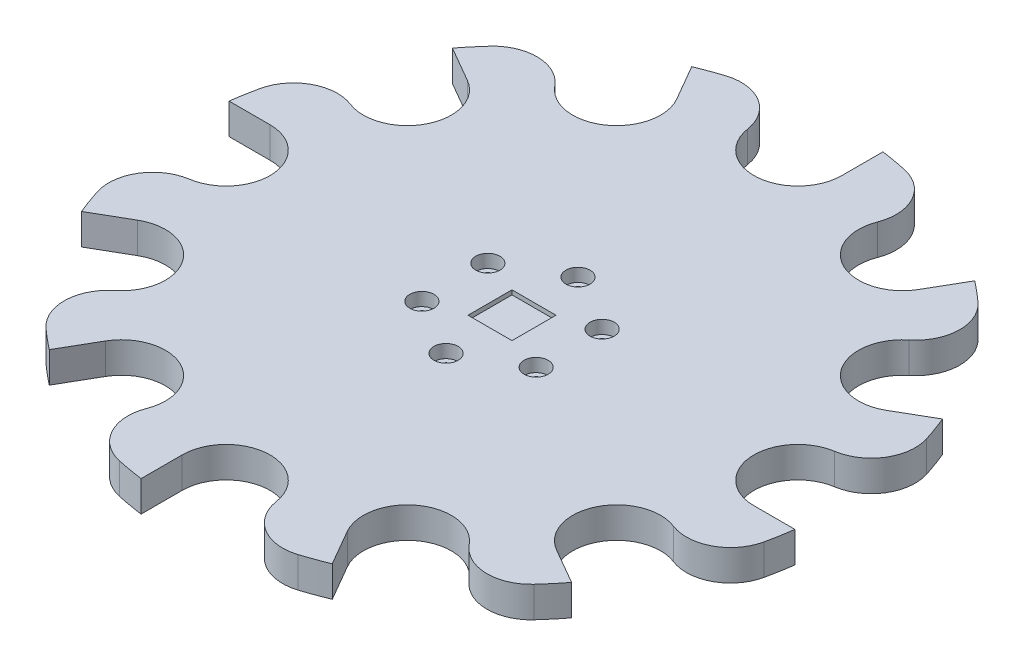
ISO-10303-21;
HEADER;
FILE_DESCRIPTION(('STEP AP214'),'2;1');
FILE_NAME('part.step','',(''),(''),'','','');
FILE_SCHEMA(('AUTOMOTIVE_DESIGN { 1 0 10303 214 1 1 1 1 }'));
ENDSEC;
DATA;
#1=APPLICATION_CONTEXT('core data for automotive mechanical design processes');
#2=APPLICATION_PROTOCOL_DEFINITION('international standard','automotive_design',2000,#1);
#3=PRODUCT_CONTEXT('',#1,'mechanical');
#4=PRODUCT('Part','Part','',(#3));
#5=PRODUCT_RELATED_PRODUCT_CATEGORY('part','',(#4));
#6=PRODUCT_DEFINITION_FORMATION('','',#4);
#7=PRODUCT_DEFINITION_CONTEXT('part definition',#1,'design');
#8=PRODUCT_DEFINITION('design','',#6,#7);
#9=PRODUCT_DEFINITION_SHAPE('','',#8);
#10=(LENGTH_UNIT() NAMED_UNIT(*) SI_UNIT(.MILLI.,.METRE.));
#11=(NAMED_UNIT(*) PLANE_ANGLE_UNIT() SI_UNIT($,.RADIAN.));
#12=(NAMED_UNIT(*) SI_UNIT($,.STERADIAN.) SOLID_ANGLE_UNIT());
#13=UNCERTAINTY_MEASURE_WITH_UNIT(LENGTH_MEASURE(1.E-05),#10,'distance_accuracy_value','');
#14=(GEOMETRIC_REPRESENTATION_CONTEXT(3) GLOBAL_UNCERTAINTY_ASSIGNED_CONTEXT((#13)) GLOBAL_UNIT_ASSIGNED_CONTEXT((#10,
#11,#12)) REPRESENTATION_CONTEXT('',''));
#15=CARTESIAN_POINT('',(0.,0.,0.));
#16=DIRECTION('',(0.,0.,1.));
#17=DIRECTION('',(1.,0.,0.));
#18=AXIS2_PLACEMENT_3D('',#15,#16,#17);
#19=CARTESIAN_POINT('',(0.,4.,0.));
#20=DIRECTION('',(0.,-1.,0.));
#21=DIRECTION('',(0.,0.,-1.));
#22=AXIS2_PLACEMENT_3D('',#19,#20,#21);
#23=PLANE('',#22);
#24=CARTESIAN_POINT('',(0.,4.,0.));
#25=DIRECTION('',(0.,-1.,0.));
#26=DIRECTION('',(0.,0.,-1.));
#27=AXIS2_PLACEMENT_3D('',#24,#25,#26);
#28=CIRCLE('',#27,40.);
#29=CARTESIAN_POINT('',(0.,4.,-40.));
#30=VERTEX_POINT('',#29);
#31=EDGE_CURVE('E706',#30,#30,#28,.T.);
#32=ORIENTED_EDGE('',*,*,#31,.T.);
#33=EDGE_LOOP('',(#32));
#34=FACE_BOUND('',#33,.T.);
#35=CARTESIAN_POINT('',(0.,4.,30.));
#36=DIRECTION('',(0.,-1.,0.));
#37=DIRECTION('',(0.,0.,-1.));
#38=AXIS2_PLACEMENT_3D('',#35,#36,#37);
#39=CIRCLE('',#38,3.25);
#40=CARTESIAN_POINT('',(0.,4.,26.75));
#41=VERTEX_POINT('',#40);
#42=EDGE_CURVE('E709',#41,#41,#39,.F.);
#43=ORIENTED_EDGE('',*,*,#42,.T.);
#44=EDGE_LOOP('',(#43));
#45=FACE_BOUND('',#44,.T.);
#46=CARTESIAN_POINT('',(-25.9807621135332,4.,14.9999999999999));
#47=DIRECTION('',(0.,-1.,0.));
#48=DIRECTION('',(0.,0.,-1.));
#49=AXIS2_PLACEMENT_3D('',#46,#47,#48);
#50=CIRCLE('',#49,3.25);
#51=CARTESIAN_POINT('',(-25.9807621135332,4.,11.7499999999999));
#52=VERTEX_POINT('',#51);
#53=EDGE_CURVE('E712',#52,#52,#50,.F.);
#54=ORIENTED_EDGE('',*,*,#53,.T.);
#55=EDGE_LOOP('',(#54));
#56=FACE_BOUND('',#55,.T.);
#57=CARTESIAN_POINT('',(-25.9807621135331,4.,-15.0000000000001));
#58=DIRECTION('',(0.,-1.,0.));
#59=DIRECTION('',(0.,0.,-1.));
#60=AXIS2_PLACEMENT_3D('',#57,#58,#59);
#61=CIRCLE('',#60,3.25);
#62=CARTESIAN_POINT('',(-25.9807621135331,4.,-18.2500000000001));
#63=VERTEX_POINT('',#62);
#64=EDGE_CURVE('E715',#63,#63,#61,.F.);
#65=ORIENTED_EDGE('',*,*,#64,.T.);
#66=EDGE_LOOP('',(#65));
#67=FACE_BOUND('',#66,.T.);
#68=CARTESIAN_POINT('',(0.,4.,-30.));
#69=DIRECTION('',(0.,-1.,0.));
#70=DIRECTION('',(0.,0.,-1.));
#71=AXIS2_PLACEMENT_3D('',#68,#69,#70);
#72=CIRCLE('',#71,3.25);
#73=CARTESIAN_POINT('',(0.,4.,-33.25));
#74=VERTEX_POINT('',#73);
#75=EDGE_CURVE('E718',#74,#74,#72,.F.);
#76=ORIENTED_EDGE('',*,*,#75,.T.);
#77=EDGE_LOOP('',(#76));
#78=FACE_BOUND('',#77,.T.);
#79=CARTESIAN_POINT('',(25.9807621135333,4.,-14.9999999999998));
#80=DIRECTION('',(0.,-1.,0.));
#81=DIRECTION('',(0.,0.,-1.));
#82=AXIS2_PLACEMENT_3D('',#79,#80,#81);
#83=CIRCLE('',#82,3.25);
#84=CARTESIAN_POINT('',(25.9807621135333,4.,-18.2499999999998));
#85=VERTEX_POINT('',#84);
#86=EDGE_CURVE('E720',#85,#85,#83,.F.);
#87=ORIENTED_EDGE('',*,*,#86,.T.);
#88=EDGE_LOOP('',(#87));
#89=FACE_BOUND('',#88,.T.);
#90=CARTESIAN_POINT('',(25.980762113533,4.,15.0000000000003));
#91=DIRECTION('',(0.,-1.,0.));
#92=DIRECTION('',(0.,0.,-1.));
#93=AXIS2_PLACEMENT_3D('',#90,#91,#92);
#94=CIRCLE('',#93,3.25);
#95=CARTESIAN_POINT('',(25.980762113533,4.,11.7500000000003));
#96=VERTEX_POINT('',#95);
#97=EDGE_CURVE('E20',#96,#96,#94,.F.);
#98=ORIENTED_EDGE('',*,*,#97,.T.);
#99=EDGE_LOOP('',(#98));
#100=FACE_BOUND('',#99,.T.);
#101=ADVANCED_FACE('F17',(#34,#45,#56,#67,#78,#89,#100),#23,.T.);
#102=CARTESIAN_POINT('',(25.980762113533,14.,15.0000000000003));
#103=DIRECTION('',(0.,-1.,0.));
#104=DIRECTION('',(0.,0.,-1.));
#105=AXIS2_PLACEMENT_3D('',#102,#103,#104);
#106=CYLINDRICAL_SURFACE('',#105,3.25);
#107=ORIENTED_EDGE('',*,*,#97,.F.);
#108=EDGE_LOOP('',(#107));
#109=FACE_BOUND('',#108,.T.);
#110=CARTESIAN_POINT('',(25.980762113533,8.,15.0000000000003));
#111=DIRECTION('',(0.,-1.,0.));
#112=DIRECTION('',(0.,0.,-1.));
#113=AXIS2_PLACEMENT_3D('',#110,#111,#112);
#114=CIRCLE('',#113,3.25);
#115=CARTESIAN_POINT('',(25.980762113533,8.,11.7500000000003));
#116=VERTEX_POINT('',#115);
#117=EDGE_CURVE('E703',#116,#116,#114,.T.);
#118=ORIENTED_EDGE('',*,*,#117,.F.);
#119=EDGE_LOOP('',(#118));
#120=FACE_BOUND('',#119,.T.);
#121=ADVANCED_FACE('F728',(#109,#120),#106,.F.);
#122=CARTESIAN_POINT('',(25.9807621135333,14.,-14.9999999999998));
#123=DIRECTION('',(0.,-1.,0.));
#124=DIRECTION('',(0.,0.,-1.));
#125=AXIS2_PLACEMENT_3D('',#122,#123,#124);
#126=CYLINDRICAL_SURFACE('',#125,3.25);
#127=ORIENTED_EDGE('',*,*,#86,.F.);
#128=EDGE_LOOP('',(#127));
#129=FACE_BOUND('',#128,.T.);
#130=CARTESIAN_POINT('',(25.9807621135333,8.,-14.9999999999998));
#131=DIRECTION('',(0.,-1.,0.));
#132=DIRECTION('',(0.,0.,-1.));
#133=AXIS2_PLACEMENT_3D('',#130,#131,#132);
#134=CIRCLE('',#133,3.25);
#135=CARTESIAN_POINT('',(25.9807621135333,8.,-18.2499999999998));
#136=VERTEX_POINT('',#135);
#137=EDGE_CURVE('E700',#136,#136,#134,.T.);
#138=ORIENTED_EDGE('',*,*,#137,.F.);
#139=EDGE_LOOP('',(#138));
#140=FACE_BOUND('',#139,.T.);
#141=ADVANCED_FACE('F731',(#129,#140),#126,.F.);
#142=CARTESIAN_POINT('',(0.,14.,-30.));
#143=DIRECTION('',(0.,-1.,0.));
#144=DIRECTION('',(0.,0.,-1.));
#145=AXIS2_PLACEMENT_3D('',#142,#143,#144);
#146=CYLINDRICAL_SURFACE('',#145,3.25);
#147=ORIENTED_EDGE('',*,*,#75,.F.);
#148=EDGE_LOOP('',(#147));
#149=FACE_BOUND('',#148,.T.);
#150=CARTESIAN_POINT('',(0.,8.,-30.));
#151=DIRECTION('',(0.,-1.,0.));
#152=DIRECTION('',(0.,0.,-1.));
#153=AXIS2_PLACEMENT_3D('',#150,#151,#152);
#154=CIRCLE('',#153,3.25);
#155=CARTESIAN_POINT('',(0.,8.,-33.25));
#156=VERTEX_POINT('',#155);
#157=EDGE_CURVE('E697',#156,#156,#154,.T.);
#158=ORIENTED_EDGE('',*,*,#157,.F.);
#159=EDGE_LOOP('',(#158));
#160=FACE_BOUND('',#159,.T.);
#161=ADVANCED_FACE('F1010',(#149,#160),#146,.F.);
#162=CARTESIAN_POINT('',(-25.9807621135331,14.,-15.0000000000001));
#163=DIRECTION('',(0.,-1.,0.));
#164=DIRECTION('',(0.,0.,-1.));
#165=AXIS2_PLACEMENT_3D('',#162,#163,#164);
#166=CYLINDRICAL_SURFACE('',#165,3.25);
#167=ORIENTED_EDGE('',*,*,#64,.F.);
#168=EDGE_LOOP('',(#167));
#169=FACE_BOUND('',#168,.T.);
#170=CARTESIAN_POINT('',(-25.9807621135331,8.,-15.0000000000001));
#171=DIRECTION('',(0.,-1.,0.));
#172=DIRECTION('',(0.,0.,-1.));
#173=AXIS2_PLACEMENT_3D('',#170,#171,#172);
#174=CIRCLE('',#173,3.25);
#175=CARTESIAN_POINT('',(-25.9807621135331,8.,-18.2500000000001));
#176=VERTEX_POINT('',#175);
#177=EDGE_CURVE('E694',#176,#176,#174,.T.);
#178=ORIENTED_EDGE('',*,*,#177,.F.);
#179=EDGE_LOOP('',(#178));
#180=FACE_BOUND('',#179,.T.);
#181=ADVANCED_FACE('F1006',(#169,#180),#166,.F.);
#182=CARTESIAN_POINT('',(-25.9807621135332,14.,14.9999999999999));
#183=DIRECTION('',(0.,-1.,0.));
#184=DIRECTION('',(0.,0.,-1.));
#185=AXIS2_PLACEMENT_3D('',#182,#183,#184);
#186=CYLINDRICAL_SURFACE('',#185,3.25);
#187=ORIENTED_EDGE('',*,*,#53,.F.);
#188=EDGE_LOOP('',(#187));
#189=FACE_BOUND('',#188,.T.);
#190=CARTESIAN_POINT('',(-25.9807621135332,8.,14.9999999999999));
#191=DIRECTION('',(0.,-1.,0.));
#192=DIRECTION('',(0.,0.,-1.));
#193=AXIS2_PLACEMENT_3D('',#190,#191,#192);
#194=CIRCLE('',#193,3.25);
#195=CARTESIAN_POINT('',(-25.9807621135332,8.,11.7499999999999));
#196=VERTEX_POINT('',#195);
#197=EDGE_CURVE('E691',#196,#196,#194,.T.);
#198=ORIENTED_EDGE('',*,*,#197,.F.);
#199=EDGE_LOOP('',(#198));
#200=FACE_BOUND('',#199,.T.);
#201=ADVANCED_FACE('F1002',(#189,#200),#186,.F.);
#202=CARTESIAN_POINT('',(0.,14.,30.));
#203=DIRECTION('',(0.,-1.,0.));
#204=DIRECTION('',(0.,0.,-1.));
#205=AXIS2_PLACEMENT_3D('',#202,#203,#204);
#206=CYLINDRICAL_SURFACE('',#205,3.25);
#207=ORIENTED_EDGE('',*,*,#42,.F.);
#208=EDGE_LOOP('',(#207));
#209=FACE_BOUND('',#208,.T.);
#210=CARTESIAN_POINT('',(0.,8.,30.));
#211=DIRECTION('',(0.,-1.,0.));
#212=DIRECTION('',(0.,0.,-1.));
#213=AXIS2_PLACEMENT_3D('',#210,#211,#212);
#214=CIRCLE('',#213,3.25);
#215=CARTESIAN_POINT('',(0.,8.,26.75));
#216=VERTEX_POINT('',#215);
#217=EDGE_CURVE('E688',#216,#216,#214,.T.);
#218=ORIENTED_EDGE('',*,*,#217,.F.);
#219=EDGE_LOOP('',(#218));
#220=FACE_BOUND('',#219,.T.);
#221=ADVANCED_FACE('F998',(#209,#220),#206,.F.);
#222=CARTESIAN_POINT('',(0.,4.,0.));
#223=DIRECTION('',(0.,-1.,0.));
#224=DIRECTION('',(0.,0.,-1.));
#225=AXIS2_PLACEMENT_3D('',#222,#223,#224);
#226=CYLINDRICAL_SURFACE('',#225,40.);
#227=ORIENTED_EDGE('',*,*,#31,.F.);
#228=EDGE_LOOP('',(#227));
#229=FACE_BOUND('',#228,.T.);
#230=CARTESIAN_POINT('',(0.,0.,0.));
#231=DIRECTION('',(0.,-1.,0.));
#232=DIRECTION('',(0.,0.,-1.));
#233=AXIS2_PLACEMENT_3D('',#230,#231,#232);
#234=CIRCLE('',#233,40.);
#235=CARTESIAN_POINT('',(0.,0.,-40.));
#236=VERTEX_POINT('',#235);
#237=EDGE_CURVE('E365',#236,#236,#234,.T.);
#238=ORIENTED_EDGE('',*,*,#237,.T.);
#239=EDGE_LOOP('',(#238));
#240=FACE_BOUND('',#239,.T.);
#241=ADVANCED_FACE('F995',(#229,#240),#226,.F.);
#242=CARTESIAN_POINT('',(0.,12.,0.));
#243=DIRECTION('',(0.,1.,0.));
#244=DIRECTION('',(0.,0.,1.));
#245=AXIS2_PLACEMENT_3D('',#242,#243,#244);
#246=PLANE('',#245);
#247=DIRECTION('',(0.,0.,1.));
#248=VECTOR('',#247,1.);
#249=CARTESIAN_POINT('',(-10.,12.,-10.));
#250=LINE('',#249,#248);
#251=CARTESIAN_POINT('',(-10.,12.,-10.));
#252=VERTEX_POINT('',#251);
#253=CARTESIAN_POINT('',(-10.,12.,10.));
#254=VERTEX_POINT('',#253);
#255=EDGE_CURVE('E345',#252,#254,#250,.T.);
#256=ORIENTED_EDGE('',*,*,#255,.T.);
#257=DIRECTION('',(1.,0.,0.));
#258=VECTOR('',#257,1.);
#259=CARTESIAN_POINT('',(-10.,12.,10.));
#260=LINE('',#259,#258);
#261=CARTESIAN_POINT('',(10.,12.,10.));
#262=VERTEX_POINT('',#261);
#263=EDGE_CURVE('E347',#254,#262,#260,.T.);
#264=ORIENTED_EDGE('',*,*,#263,.T.);
#265=DIRECTION('',(0.,0.,-1.));
#266=VECTOR('',#265,1.);
#267=CARTESIAN_POINT('',(10.,12.,-10.));
#268=LINE('',#267,#266);
#269=CARTESIAN_POINT('',(10.,12.,-10.));
#270=VERTEX_POINT('',#269);
#271=EDGE_CURVE('E350',#262,#270,#268,.T.);
#272=ORIENTED_EDGE('',*,*,#271,.T.);
#273=DIRECTION('',(-1.,0.,0.));
#274=VECTOR('',#273,1.);
#275=CARTESIAN_POINT('',(-10.,12.,-10.));
#276=LINE('',#275,#274);
#277=EDGE_CURVE('E337',#270,#252,#276,.T.);
#278=ORIENTED_EDGE('',*,*,#277,.T.);
#279=EDGE_LOOP('',(#256,#264,#272,#278));
#280=FACE_BOUND('',#279,.T.);
#281=ADVANCED_FACE('F349',(#280),#246,.T.);
#282=CARTESIAN_POINT('',(25.980762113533,8.,15.0000000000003));
#283=DIRECTION('',(0.,1.,0.));
#284=DIRECTION('',(0.,0.,1.));
#285=AXIS2_PLACEMENT_3D('',#282,#283,#284);
#286=PLANE('',#285);
#287=ORIENTED_EDGE('',*,*,#117,.T.);
#288=EDGE_LOOP('',(#287));
#289=FACE_BOUND('',#288,.T.);
#290=CARTESIAN_POINT('',(25.980762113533,8.,15.0000000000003));
#291=DIRECTION('',(0.,1.,0.));
#292=DIRECTION('',(0.,0.,1.));
#293=AXIS2_PLACEMENT_3D('',#290,#291,#292);
#294=CIRCLE('',#293,5.5);
#295=CARTESIAN_POINT('',(25.980762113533,8.,20.5000000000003));
#296=VERTEX_POINT('',#295);
#297=EDGE_CURVE('E682',#296,#296,#294,.T.);
#298=ORIENTED_EDGE('',*,*,#297,.T.);
#299=EDGE_LOOP('',(#298));
#300=FACE_BOUND('',#299,.T.);
#301=ADVANCED_FACE('F734',(#289,#300),#286,.T.);
#302=CARTESIAN_POINT('',(25.9807621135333,8.,-14.9999999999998));
#303=DIRECTION('',(0.,1.,0.));
#304=DIRECTION('',(0.,0.,1.));
#305=AXIS2_PLACEMENT_3D('',#302,#303,#304);
#306=PLANE('',#305);
#307=ORIENTED_EDGE('',*,*,#137,.T.);
#308=EDGE_LOOP('',(#307));
#309=FACE_BOUND('',#308,.T.);
#310=CARTESIAN_POINT('',(25.9807621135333,8.,-14.9999999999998));
#311=DIRECTION('',(0.,1.,0.));
#312=DIRECTION('',(0.,0.,1.));
#313=AXIS2_PLACEMENT_3D('',#310,#311,#312);
#314=CIRCLE('',#313,5.5);
#315=CARTESIAN_POINT('',(25.9807621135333,8.,-9.49999999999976));
#316=VERTEX_POINT('',#315);
#317=EDGE_CURVE('E679',#316,#316,#314,.T.);
#318=ORIENTED_EDGE('',*,*,#317,.T.);
#319=EDGE_LOOP('',(#318));
#320=FACE_BOUND('',#319,.T.);
#321=ADVANCED_FACE('F737',(#309,#320),#306,.T.);
#322=CARTESIAN_POINT('',(0.,8.,-30.));
#323=DIRECTION('',(0.,1.,0.));
#324=DIRECTION('',(0.,0.,1.));
#325=AXIS2_PLACEMENT_3D('',#322,#323,#324);
#326=PLANE('',#325);
#327=ORIENTED_EDGE('',*,*,#157,.T.);
#328=EDGE_LOOP('',(#327));
#329=FACE_BOUND('',#328,.T.);
#330=CARTESIAN_POINT('',(0.,8.,-30.));
#331=DIRECTION('',(0.,1.,0.));
#332=DIRECTION('',(0.,0.,1.));
#333=AXIS2_PLACEMENT_3D('',#330,#331,#332);
#334=CIRCLE('',#333,5.5);
#335=CARTESIAN_POINT('',(0.,8.,-24.5));
#336=VERTEX_POINT('',#335);
#337=EDGE_CURVE('E676',#336,#336,#334,.T.);
#338=ORIENTED_EDGE('',*,*,#337,.T.);
#339=EDGE_LOOP('',(#338));
#340=FACE_BOUND('',#339,.T.);
#341=ADVANCED_FACE('F977',(#329,#340),#326,.T.);
#342=CARTESIAN_POINT('',(-25.9807621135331,8.,-15.0000000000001));
#343=DIRECTION('',(0.,1.,0.));
#344=DIRECTION('',(0.,0.,1.));
#345=AXIS2_PLACEMENT_3D('',#342,#343,#344);
#346=PLANE('',#345);
#347=ORIENTED_EDGE('',*,*,#177,.T.);
#348=EDGE_LOOP('',(#347));
#349=FACE_BOUND('',#348,.T.);
#350=CARTESIAN_POINT('',(-25.9807621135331,8.,-15.0000000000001));
#351=DIRECTION('',(0.,1.,0.));
#352=DIRECTION('',(0.,0.,1.));
#353=AXIS2_PLACEMENT_3D('',#350,#351,#352);
#354=CIRCLE('',#353,5.5);
#355=CARTESIAN_POINT('',(-25.9807621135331,8.,-9.50000000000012));
#356=VERTEX_POINT('',#355);
#357=EDGE_CURVE('E673',#356,#356,#354,.T.);
#358=ORIENTED_EDGE('',*,*,#357,.T.);
#359=EDGE_LOOP('',(#358));
#360=FACE_BOUND('',#359,.T.);
#361=ADVANCED_FACE('F979',(#349,#360),#346,.T.);
#362=CARTESIAN_POINT('',(-25.9807621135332,8.,14.9999999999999));
#363=DIRECTION('',(0.,1.,0.));
#364=DIRECTION('',(0.,0.,1.));
#365=AXIS2_PLACEMENT_3D('',#362,#363,#364);
#366=PLANE('',#365);
#367=ORIENTED_EDGE('',*,*,#197,.T.);
#368=EDGE_LOOP('',(#367));
#369=FACE_BOUND('',#368,.T.);
#370=CARTESIAN_POINT('',(-25.9807621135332,8.,14.9999999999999));
#371=DIRECTION('',(0.,1.,0.));
#372=DIRECTION('',(0.,0.,1.));
#373=AXIS2_PLACEMENT_3D('',#370,#371,#372);
#374=CIRCLE('',#373,5.5);
#375=CARTESIAN_POINT('',(-25.9807621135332,8.,20.4999999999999));
#376=VERTEX_POINT('',#375);
#377=EDGE_CURVE('E670',#376,#376,#374,.T.);
#378=ORIENTED_EDGE('',*,*,#377,.T.);
#379=EDGE_LOOP('',(#378));
#380=FACE_BOUND('',#379,.T.);
#381=ADVANCED_FACE('F986',(#369,#380),#366,.T.);
#382=CARTESIAN_POINT('',(0.,8.,30.));
#383=DIRECTION('',(0.,1.,0.));
#384=DIRECTION('',(0.,0.,1.));
#385=AXIS2_PLACEMENT_3D('',#382,#383,#384);
#386=PLANE('',#385);
#387=ORIENTED_EDGE('',*,*,#217,.T.);
#388=EDGE_LOOP('',(#387));
#389=FACE_BOUND('',#388,.T.);
#390=CARTESIAN_POINT('',(0.,8.,30.));
#391=DIRECTION('',(0.,1.,0.));
#392=DIRECTION('',(0.,0.,1.));
#393=AXIS2_PLACEMENT_3D('',#390,#391,#392);
#394=CIRCLE('',#393,5.5);
#395=CARTESIAN_POINT('',(0.,8.,35.5));
#396=VERTEX_POINT('',#395);
#397=EDGE_CURVE('E667',#396,#396,#394,.T.);
#398=ORIENTED_EDGE('',*,*,#397,.T.);
#399=EDGE_LOOP('',(#398));
#400=FACE_BOUND('',#399,.T.);
#401=ADVANCED_FACE('F1083',(#389,#400),#386,.T.);
#402=CARTESIAN_POINT('',(0.,0.,0.));
#403=DIRECTION('',(0.,1.,0.));
#404=DIRECTION('',(0.,0.,1.));
#405=AXIS2_PLACEMENT_3D('',#402,#403,#404);
#406=PLANE('',#405);
#407=CARTESIAN_POINT('',(-96.1516853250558,0.,-87.4920191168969));
#408=DIRECTION('',(0.,1.,0.));
#409=DIRECTION('',(0.,0.,1.));
#410=AXIS2_PLACEMENT_3D('',#407,#408,#409);
#411=CIRCLE('',#410,20.);
#412=CARTESIAN_POINT('',(-80.5758426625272,0.,-100.037660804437));
#413=VERTEX_POINT('',#412);
#414=CARTESIAN_POINT('',(-110.944252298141,0.,-100.952329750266));
#415=VERTEX_POINT('',#414);
#416=EDGE_CURVE('E324',#413,#415,#411,.T.);
#417=ORIENTED_EDGE('',*,*,#416,.F.);
#418=CARTESIAN_POINT('',(-64.9999999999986,0.,-112.583302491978));
#419=DIRECTION('',(0.,1.,0.));
#420=DIRECTION('',(0.,0.,1.));
#421=AXIS2_PLACEMENT_3D('',#418,#419,#420);
#422=CIRCLE('',#421,20.);
#423=CARTESIAN_POINT('',(-47.6794919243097,0.,-122.583302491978));
#424=VERTEX_POINT('',#423);
#425=EDGE_CURVE('E329',#413,#424,#422,.T.);
#426=ORIENTED_EDGE('',*,*,#425,.T.);
#427=DIRECTION('',(-0.499999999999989,0.,-0.866025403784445));
#428=VECTOR('',#427,1.);
#429=CARTESIAN_POINT('',(-57.6794919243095,0.,-139.903810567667));
#430=LINE('',#429,#428);
#431=CARTESIAN_POINT('',(-57.009835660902,0.,-138.743931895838));
#432=VERTEX_POINT('',#431);
#433=EDGE_CURVE('E376',#424,#432,#430,.T.);
#434=ORIENTED_EDGE('',*,*,#433,.T.);
#435=CARTESIAN_POINT('',(0.,0.,0.));
#436=DIRECTION('',(0.,-1.,0.));
#437=DIRECTION('',(0.,0.,-1.));
#438=AXIS2_PLACEMENT_3D('',#435,#436,#437);
#439=CIRCLE('',#438,150.);
#440=CARTESIAN_POINT('',(-45.6043760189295,0.,-142.899408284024));
#441=VERTEX_POINT('',#440);
#442=EDGE_CURVE('E566',#441,#432,#439,.F.);
#443=ORIENTED_EDGE('',*,*,#442,.F.);
#444=CARTESIAN_POINT('',(-39.5237925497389,0.,-123.846153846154));
#445=DIRECTION('',(0.,1.,0.));
#446=DIRECTION('',(0.,0.,1.));
#447=AXIS2_PLACEMENT_3D('',#444,#445,#446);
#448=CIRCLE('',#447,20.);
#449=CARTESIAN_POINT('',(-19.7618962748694,0.,-126.923076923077));
#450=VERTEX_POINT('',#449);
#451=EDGE_CURVE('E569',#450,#441,#448,.T.);
#452=ORIENTED_EDGE('',*,*,#451,.F.);
#453=CARTESIAN_POINT('',(0.,0.,-130.));
#454=DIRECTION('',(0.,1.,0.));
#455=DIRECTION('',(0.,0.,1.));
#456=AXIS2_PLACEMENT_3D('',#453,#454,#455);
#457=CIRCLE('',#456,20.);
#458=CARTESIAN_POINT('',(20.,0.,-130.));
#459=VERTEX_POINT('',#458);
#460=EDGE_CURVE('E573',#450,#459,#457,.T.);
#461=ORIENTED_EDGE('',*,*,#460,.T.);
#462=DIRECTION('',(0.,0.,-1.));
#463=VECTOR('',#462,1.);
#464=CARTESIAN_POINT('',(20.,0.,-150.));
#465=LINE('',#464,#463);
#466=CARTESIAN_POINT('',(20.,0.,-148.660687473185));
#467=VERTEX_POINT('',#466);
#468=EDGE_CURVE('E381',#459,#467,#465,.T.);
#469=ORIENTED_EDGE('',*,*,#468,.T.);
#470=CARTESIAN_POINT('',(0.,0.,0.));
#471=DIRECTION('',(0.,-1.,0.));
#472=DIRECTION('',(0.,0.,-1.));
#473=AXIS2_PLACEMENT_3D('',#470,#471,#472);
#474=CIRCLE('',#473,150.);
#475=CARTESIAN_POINT('',(31.9551559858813,0.,-146.556705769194));
#476=VERTEX_POINT('',#475);
#477=EDGE_CURVE('E575',#476,#467,#474,.F.);
#478=ORIENTED_EDGE('',*,*,#477,.F.);
#479=CARTESIAN_POINT('',(27.6944685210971,0.,-127.015811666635));
#480=DIRECTION('',(0.,1.,0.));
#481=DIRECTION('',(0.,0.,1.));
#482=AXIS2_PLACEMENT_3D('',#479,#480,#481);
#483=CIRCLE('',#482,20.);
#484=CARTESIAN_POINT('',(46.3472342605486,0.,-119.799557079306));
#485=VERTEX_POINT('',#484);
#486=EDGE_CURVE('E578',#485,#476,#483,.T.);
#487=ORIENTED_EDGE('',*,*,#486,.F.);
#488=CARTESIAN_POINT('',(65.0000000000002,0.,-112.583302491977));
#489=DIRECTION('',(0.,1.,0.));
#490=DIRECTION('',(0.,0.,1.));
#491=AXIS2_PLACEMENT_3D('',#488,#489,#490);
#492=CIRCLE('',#491,20.);
#493=CARTESIAN_POINT('',(82.3205080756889,0.,-102.583302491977));
#494=VERTEX_POINT('',#493);
#495=EDGE_CURVE('E581',#485,#494,#492,.T.);
#496=ORIENTED_EDGE('',*,*,#495,.T.);
#497=DIRECTION('',(0.500000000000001,0.,-0.866025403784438));
#498=VECTOR('',#497,1.);
#499=CARTESIAN_POINT('',(92.3205080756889,0.,-119.903810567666));
#500=LINE('',#499,#498);
#501=CARTESIAN_POINT('',(91.6508518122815,0.,-118.743931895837));
#502=VERTEX_POINT('',#501);
#503=EDGE_CURVE('E386',#494,#502,#500,.T.);
#504=ORIENTED_EDGE('',*,*,#503,.T.);
#505=CARTESIAN_POINT('',(0.,0.,0.));
#506=DIRECTION('',(0.,-1.,0.));
#507=DIRECTION('',(0.,0.,-1.));
#508=AXIS2_PLACEMENT_3D('',#505,#506,#507);
#509=CIRCLE('',#508,150.);
#510=CARTESIAN_POINT('',(100.952329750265,0.,-110.944252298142));
#511=VERTEX_POINT('',#510);
#512=EDGE_CURVE('E583',#511,#502,#509,.F.);
#513=ORIENTED_EDGE('',*,*,#512,.F.);
#514=CARTESIAN_POINT('',(87.4920191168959,0.,-96.1516853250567));
#515=DIRECTION('',(0.,1.,0.));
#516=DIRECTION('',(0.,0.,1.));
#517=AXIS2_PLACEMENT_3D('',#514,#515,#516);
#518=CIRCLE('',#517,20.);
#519=CARTESIAN_POINT('',(100.037660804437,0.,-80.5758426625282));
#520=VERTEX_POINT('',#519);
#521=EDGE_CURVE('E586',#520,#511,#518,.T.);
#522=ORIENTED_EDGE('',*,*,#521,.F.);
#523=CARTESIAN_POINT('',(112.583302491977,0.,-64.9999999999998));
#524=DIRECTION('',(0.,1.,0.));
#525=DIRECTION('',(0.,0.,1.));
#526=AXIS2_PLACEMENT_3D('',#523,#524,#525);
#527=CIRCLE('',#526,20.);
#528=CARTESIAN_POINT('',(122.583302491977,0.,-47.679491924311));
#529=VERTEX_POINT('',#528);
#530=EDGE_CURVE('E589',#520,#529,#527,.T.);
#531=ORIENTED_EDGE('',*,*,#530,.T.);
#532=DIRECTION('',(0.86602540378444,0.,-0.499999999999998));
#533=VECTOR('',#532,1.);
#534=CARTESIAN_POINT('',(139.903810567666,0.,-57.6794919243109));
#535=LINE('',#534,#533);
#536=CARTESIAN_POINT('',(138.743931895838,0.,-57.0098356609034));
#537=VERTEX_POINT('',#536);
#538=EDGE_CURVE('E391',#529,#537,#535,.T.);
#539=ORIENTED_EDGE('',*,*,#538,.T.);
#540=CARTESIAN_POINT('',(0.,0.,0.));
#541=DIRECTION('',(0.,-1.,0.));
#542=DIRECTION('',(0.,0.,-1.));
#543=AXIS2_PLACEMENT_3D('',#540,#541,#542);
#544=CIRCLE('',#543,150.);
#545=CARTESIAN_POINT('',(142.899408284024,0.,-45.6043760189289));
#546=VERTEX_POINT('',#545);
#547=EDGE_CURVE('E591',#546,#537,#544,.F.);
#548=ORIENTED_EDGE('',*,*,#547,.F.);
#549=CARTESIAN_POINT('',(123.846153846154,0.,-39.5237925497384));
#550=DIRECTION('',(0.,1.,0.));
#551=DIRECTION('',(0.,0.,1.));
#552=AXIS2_PLACEMENT_3D('',#549,#550,#551);
#553=CIRCLE('',#552,20.);
#554=CARTESIAN_POINT('',(126.923076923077,0.,-19.761896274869));
#555=VERTEX_POINT('',#554);
#556=EDGE_CURVE('E594',#555,#546,#553,.T.);
#557=ORIENTED_EDGE('',*,*,#556,.F.);
#558=CARTESIAN_POINT('',(130.,0.,4.56341867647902E-13));
#559=DIRECTION('',(0.,1.,0.));
#560=DIRECTION('',(0.,0.,1.));
#561=AXIS2_PLACEMENT_3D('',#558,#559,#560);
#562=CIRCLE('',#561,20.);
#563=CARTESIAN_POINT('',(130.,0.,20.0000000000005));
#564=VERTEX_POINT('',#563);
#565=EDGE_CURVE('E597',#555,#564,#562,.T.);
#566=ORIENTED_EDGE('',*,*,#565,.T.);
#567=DIRECTION('',(1.,0.,0.));
#568=VECTOR('',#567,1.);
#569=CARTESIAN_POINT('',(150.,0.,20.0000000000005));
#570=LINE('',#569,#568);
#571=CARTESIAN_POINT('',(148.660687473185,0.,20.0000000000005));
#572=VERTEX_POINT('',#571);
#573=EDGE_CURVE('E396',#564,#572,#570,.T.);
#574=ORIENTED_EDGE('',*,*,#573,.T.);
#575=CARTESIAN_POINT('',(0.,0.,0.));
#576=DIRECTION('',(0.,-1.,0.));
#577=DIRECTION('',(0.,0.,-1.));
#578=AXIS2_PLACEMENT_3D('',#575,#576,#577);
#579=CIRCLE('',#578,150.);
#580=CARTESIAN_POINT('',(146.556705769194,0.,31.9551559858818));
#581=VERTEX_POINT('',#580);
#582=EDGE_CURVE('E600',#581,#572,#579,.F.);
#583=ORIENTED_EDGE('',*,*,#582,.F.);
#584=CARTESIAN_POINT('',(127.015811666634,0.,27.6944685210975));
#585=DIRECTION('',(0.,1.,0.));
#586=DIRECTION('',(0.,0.,1.));
#587=AXIS2_PLACEMENT_3D('',#584,#585,#586);
#588=CIRCLE('',#587,20.);
#589=CARTESIAN_POINT('',(119.799557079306,0.,46.347234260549));
#590=VERTEX_POINT('',#589);
#591=EDGE_CURVE('E603',#590,#581,#588,.T.);
#592=ORIENTED_EDGE('',*,*,#591,.F.);
#593=CARTESIAN_POINT('',(112.583302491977,0.,65.0000000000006));
#594=DIRECTION('',(0.,1.,0.));
#595=DIRECTION('',(0.,0.,1.));
#596=AXIS2_PLACEMENT_3D('',#593,#594,#595);
#597=CIRCLE('',#596,20.);
#598=CARTESIAN_POINT('',(102.583302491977,0.,82.3205080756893));
#599=VERTEX_POINT('',#598);
#600=EDGE_CURVE('E606',#590,#599,#597,.T.);
#601=ORIENTED_EDGE('',*,*,#600,.T.);
#602=DIRECTION('',(0.866025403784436,0.,0.500000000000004));
#603=VECTOR('',#602,1.);
#604=CARTESIAN_POINT('',(119.903810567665,0.,92.3205080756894));
#605=LINE('',#604,#603);
#606=CARTESIAN_POINT('',(118.743931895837,0.,91.6508518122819));
#607=VERTEX_POINT('',#606);
#608=EDGE_CURVE('E401',#599,#607,#605,.T.);
#609=ORIENTED_EDGE('',*,*,#608,.T.);
#610=CARTESIAN_POINT('',(0.,0.,0.));
#611=DIRECTION('',(0.,-1.,0.));
#612=DIRECTION('',(0.,0.,-1.));
#613=AXIS2_PLACEMENT_3D('',#610,#611,#612);
#614=CIRCLE('',#613,150.);
#615=CARTESIAN_POINT('',(110.944252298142,0.,100.952329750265));
#616=VERTEX_POINT('',#615);
#617=EDGE_CURVE('E609',#616,#607,#614,.F.);
#618=ORIENTED_EDGE('',*,*,#617,.F.);
#619=CARTESIAN_POINT('',(96.1516853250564,0.,87.4920191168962));
#620=DIRECTION('',(0.,1.,0.));
#621=DIRECTION('',(0.,0.,1.));
#622=AXIS2_PLACEMENT_3D('',#619,#620,#621);
#623=CIRCLE('',#622,20.);
#624=CARTESIAN_POINT('',(80.5758426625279,0.,100.037660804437));
#625=VERTEX_POINT('',#624);
#626=EDGE_CURVE('E612',#625,#616,#623,.T.);
#627=ORIENTED_EDGE('',*,*,#626,.F.);
#628=CARTESIAN_POINT('',(64.9999999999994,0.,112.583302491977));
#629=DIRECTION('',(0.,1.,0.));
#630=DIRECTION('',(0.,0.,1.));
#631=AXIS2_PLACEMENT_3D('',#628,#629,#630);
#632=CIRCLE('',#631,20.);
#633=CARTESIAN_POINT('',(47.6794919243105,0.,122.583302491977));
#634=VERTEX_POINT('',#633);
#635=EDGE_CURVE('E615',#625,#634,#632,.T.);
#636=ORIENTED_EDGE('',*,*,#635,.T.);
#637=DIRECTION('',(0.499999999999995,0.,0.866025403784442));
#638=VECTOR('',#637,1.);
#639=CARTESIAN_POINT('',(57.6794919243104,0.,139.903810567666));
#640=LINE('',#639,#638);
#641=CARTESIAN_POINT('',(57.009835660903,0.,138.743931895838));
#642=VERTEX_POINT('',#641);
#643=EDGE_CURVE('E406',#634,#642,#640,.T.);
#644=ORIENTED_EDGE('',*,*,#643,.T.);
#645=CARTESIAN_POINT('',(0.,0.,0.));
#646=DIRECTION('',(0.,-1.,0.));
#647=DIRECTION('',(0.,0.,-1.));
#648=AXIS2_PLACEMENT_3D('',#645,#646,#647);
#649=CIRCLE('',#648,150.);
#650=CARTESIAN_POINT('',(45.6043760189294,0.,142.899408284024));
#651=VERTEX_POINT('',#650);
#652=EDGE_CURVE('E618',#651,#642,#649,.F.);
#653=ORIENTED_EDGE('',*,*,#652,.F.);
#654=CARTESIAN_POINT('',(39.5237925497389,0.,123.846153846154));
#655=DIRECTION('',(0.,1.,0.));
#656=DIRECTION('',(0.,0.,1.));
#657=AXIS2_PLACEMENT_3D('',#654,#655,#656);
#658=CIRCLE('',#657,20.);
#659=CARTESIAN_POINT('',(19.7618962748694,0.,126.923076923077));
#660=VERTEX_POINT('',#659);
#661=EDGE_CURVE('E621',#660,#651,#658,.T.);
#662=ORIENTED_EDGE('',*,*,#661,.F.);
#663=CARTESIAN_POINT('',(0.,0.,130.));
#664=DIRECTION('',(0.,1.,0.));
#665=DIRECTION('',(0.,0.,1.));
#666=AXIS2_PLACEMENT_3D('',#663,#664,#665);
#667=CIRCLE('',#666,20.);
#668=CARTESIAN_POINT('',(-20.,0.,130.));
#669=VERTEX_POINT('',#668);
#670=EDGE_CURVE('E624',#660,#669,#667,.T.);
#671=ORIENTED_EDGE('',*,*,#670,.T.);
#672=DIRECTION('',(0.,0.,1.));
#673=VECTOR('',#672,1.);
#674=CARTESIAN_POINT('',(-20.,0.,150.));
#675=LINE('',#674,#673);
#676=CARTESIAN_POINT('',(-20.,0.,148.660687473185));
#677=VERTEX_POINT('',#676);
#678=EDGE_CURVE('E411',#669,#677,#675,.T.);
#679=ORIENTED_EDGE('',*,*,#678,.T.);
#680=CARTESIAN_POINT('',(0.,0.,0.));
#681=DIRECTION('',(0.,-1.,0.));
#682=DIRECTION('',(0.,0.,-1.));
#683=AXIS2_PLACEMENT_3D('',#680,#681,#682);
#684=CIRCLE('',#683,150.);
#685=CARTESIAN_POINT('',(-31.9551559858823,0.,146.556705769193));
#686=VERTEX_POINT('',#685);
#687=EDGE_CURVE('E627',#686,#677,#684,.F.);
#688=ORIENTED_EDGE('',*,*,#687,.F.);
#689=CARTESIAN_POINT('',(-27.694468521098,0.,127.015811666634));
#690=DIRECTION('',(0.,1.,0.));
#691=DIRECTION('',(0.,0.,1.));
#692=AXIS2_PLACEMENT_3D('',#689,#690,#691);
#693=CIRCLE('',#692,20.);
#694=CARTESIAN_POINT('',(-46.3472342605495,0.,119.799557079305));
#695=VERTEX_POINT('',#694);
#696=EDGE_CURVE('E630',#695,#686,#693,.T.);
#697=ORIENTED_EDGE('',*,*,#696,.F.);
#698=CARTESIAN_POINT('',(-65.000000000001,0.,112.583302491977));
#699=DIRECTION('',(0.,1.,0.));
#700=DIRECTION('',(0.,0.,1.));
#701=AXIS2_PLACEMENT_3D('',#698,#699,#700);
#702=CIRCLE('',#701,20.);
#703=CARTESIAN_POINT('',(-82.3205080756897,0.,102.583302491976));
#704=VERTEX_POINT('',#703);
#705=EDGE_CURVE('E633',#695,#704,#702,.T.);
#706=ORIENTED_EDGE('',*,*,#705,.T.);
#707=DIRECTION('',(-0.500000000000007,0.,0.866025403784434));
#708=VECTOR('',#707,1.);
#709=CARTESIAN_POINT('',(-92.3205080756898,0.,119.903810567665));
#710=LINE('',#709,#708);
#711=CARTESIAN_POINT('',(-91.6508518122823,0.,118.743931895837));
#712=VERTEX_POINT('',#711);
#713=EDGE_CURVE('E416',#704,#712,#710,.T.);
#714=ORIENTED_EDGE('',*,*,#713,.T.);
#715=CARTESIAN_POINT('',(0.,0.,0.));
#716=DIRECTION('',(0.,-1.,0.));
#717=DIRECTION('',(0.,0.,-1.));
#718=AXIS2_PLACEMENT_3D('',#715,#716,#717);
#719=CIRCLE('',#718,150.);
#720=CARTESIAN_POINT('',(-100.952329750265,0.,110.944252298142));
#721=VERTEX_POINT('',#720);
#722=EDGE_CURVE('E636',#721,#712,#719,.F.);
#723=ORIENTED_EDGE('',*,*,#722,.F.);
#724=CARTESIAN_POINT('',(-87.4920191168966,0.,96.1516853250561));
#725=DIRECTION('',(0.,1.,0.));
#726=DIRECTION('',(0.,0.,1.));
#727=AXIS2_PLACEMENT_3D('',#724,#725,#726);
#728=CIRCLE('',#727,20.);
#729=CARTESIAN_POINT('',(-100.037660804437,0.,80.5758426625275));
#730=VERTEX_POINT('',#729);
#731=EDGE_CURVE('E639',#730,#721,#728,.T.);
#732=ORIENTED_EDGE('',*,*,#731,.F.);
#733=CARTESIAN_POINT('',(-112.583302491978,0.,64.999999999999));
#734=DIRECTION('',(0.,1.,0.));
#735=DIRECTION('',(0.,0.,1.));
#736=AXIS2_PLACEMENT_3D('',#733,#734,#735);
#737=CIRCLE('',#736,20.);
#738=CARTESIAN_POINT('',(-122.583302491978,0.,47.6794919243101));
#739=VERTEX_POINT('',#738);
#740=EDGE_CURVE('E642',#730,#739,#737,.T.);
#741=ORIENTED_EDGE('',*,*,#740,.T.);
#742=DIRECTION('',(-0.866025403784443,0.,0.499999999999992));
#743=VECTOR('',#742,1.);
#744=CARTESIAN_POINT('',(-139.903810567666,0.,57.67949192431));
#745=LINE('',#744,#743);
#746=CARTESIAN_POINT('',(-138.743931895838,0.,57.0098356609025));
#747=VERTEX_POINT('',#746);
#748=EDGE_CURVE('E421',#739,#747,#745,.T.);
#749=ORIENTED_EDGE('',*,*,#748,.T.);
#750=CARTESIAN_POINT('',(0.,0.,0.));
#751=DIRECTION('',(0.,-1.,0.));
#752=DIRECTION('',(0.,0.,-1.));
#753=AXIS2_PLACEMENT_3D('',#750,#751,#752);
#754=CIRCLE('',#753,150.);
#755=CARTESIAN_POINT('',(-142.899408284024,0.,45.604376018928));
#756=VERTEX_POINT('',#755);
#757=EDGE_CURVE('E645',#756,#747,#754,.F.);
#758=ORIENTED_EDGE('',*,*,#757,.F.);
#759=CARTESIAN_POINT('',(-123.846153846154,0.,39.5237925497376));
#760=DIRECTION('',(0.,1.,0.));
#761=DIRECTION('',(0.,0.,1.));
#762=AXIS2_PLACEMENT_3D('',#759,#760,#761);
#763=CIRCLE('',#762,20.);
#764=CARTESIAN_POINT('',(-126.923076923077,0.,19.7618962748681));
#765=VERTEX_POINT('',#764);
#766=EDGE_CURVE('E648',#765,#756,#763,.T.);
#767=ORIENTED_EDGE('',*,*,#766,.F.);
#768=CARTESIAN_POINT('',(-130.,0.,-1.36412701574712E-12));
#769=DIRECTION('',(0.,1.,0.));
#770=DIRECTION('',(0.,0.,1.));
#771=AXIS2_PLACEMENT_3D('',#768,#769,#770);
#772=CIRCLE('',#771,20.);
#773=CARTESIAN_POINT('',(-130.,0.,-20.0000000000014));
#774=VERTEX_POINT('',#773);
#775=EDGE_CURVE('E651',#765,#774,#772,.T.);
#776=ORIENTED_EDGE('',*,*,#775,.T.);
#777=DIRECTION('',(-1.,0.,0.));
#778=VECTOR('',#777,1.);
#779=CARTESIAN_POINT('',(-150.,0.,-20.0000000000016));
#780=LINE('',#779,#778);
#781=CARTESIAN_POINT('',(-148.660687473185,0.,-20.0000000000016));
#782=VERTEX_POINT('',#781);
#783=EDGE_CURVE('E426',#774,#782,#780,.T.);
#784=ORIENTED_EDGE('',*,*,#783,.T.);
#785=CARTESIAN_POINT('',(0.,0.,0.));
#786=DIRECTION('',(0.,-1.,0.));
#787=DIRECTION('',(0.,0.,-1.));
#788=AXIS2_PLACEMENT_3D('',#785,#786,#787);
#789=CIRCLE('',#788,150.);
#790=CARTESIAN_POINT('',(-146.556705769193,0.,-31.9551559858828));
#791=VERTEX_POINT('',#790);
#792=EDGE_CURVE('E654',#791,#782,#789,.F.);
#793=ORIENTED_EDGE('',*,*,#792,.F.);
#794=CARTESIAN_POINT('',(-127.015811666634,0.,-27.6944685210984));
#795=DIRECTION('',(0.,1.,0.));
#796=DIRECTION('',(0.,0.,1.));
#797=AXIS2_PLACEMENT_3D('',#794,#795,#796);
#798=CIRCLE('',#797,20.);
#799=CARTESIAN_POINT('',(-119.799557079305,0.,-46.3472342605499));
#800=VERTEX_POINT('',#799);
#801=EDGE_CURVE('E657',#800,#791,#798,.T.);
#802=ORIENTED_EDGE('',*,*,#801,.F.);
#803=CARTESIAN_POINT('',(-112.583302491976,0.,-65.0000000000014));
#804=DIRECTION('',(0.,1.,0.));
#805=DIRECTION('',(0.,0.,1.));
#806=AXIS2_PLACEMENT_3D('',#803,#804,#805);
#807=CIRCLE('',#806,20.);
#808=CARTESIAN_POINT('',(-102.583302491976,0.,-82.32050807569));
#809=VERTEX_POINT('',#808);
#810=EDGE_CURVE('E660',#800,#809,#807,.T.);
#811=ORIENTED_EDGE('',*,*,#810,.T.);
#812=DIRECTION('',(-0.866025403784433,0.,-0.50000000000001));
#813=VECTOR('',#812,1.);
#814=CARTESIAN_POINT('',(-119.903810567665,0.,-92.3205080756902));
#815=LINE('',#814,#813);
#816=CARTESIAN_POINT('',(-118.743931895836,0.,-91.6508518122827));
#817=VERTEX_POINT('',#816);
#818=EDGE_CURVE('E431',#809,#817,#815,.T.);
#819=ORIENTED_EDGE('',*,*,#818,.T.);
#820=CARTESIAN_POINT('',(0.,0.,0.));
#821=DIRECTION('',(0.,-1.,0.));
#822=DIRECTION('',(0.,0.,-1.));
#823=AXIS2_PLACEMENT_3D('',#820,#821,#822);
#824=CIRCLE('',#823,150.);
#825=EDGE_CURVE('E662',#415,#817,#824,.F.);
#826=ORIENTED_EDGE('',*,*,#825,.F.);
#827=EDGE_LOOP('',(#417,#426,#434,#443,#452,#461,#469,#478,#487,#496,#504,#513,#522,#531,#539,
#548,#557,#566,#574,#583,#592,#601,#609,#618,#627,#636,#644,#653,#662,#671,#679,#688,#697,#706,
#714,#723,#732,#741,#749,#758,#767,#776,#784,#793,#802,#811,#819,#826));
#828=FACE_BOUND('',#827,.T.);
#829=ORIENTED_EDGE('',*,*,#237,.F.);
#830=EDGE_LOOP('',(#829));
#831=FACE_BOUND('',#830,.T.);
#832=ADVANCED_FACE('F1092',(#828,#831),#406,.F.);
#833=CARTESIAN_POINT('',(10.,12.,-10.));
#834=DIRECTION('',(1.,0.,0.));
#835=DIRECTION('',(0.,0.,-1.));
#836=AXIS2_PLACEMENT_3D('',#833,#834,#835);
#837=PLANE('',#836);
#838=DIRECTION('',(0.,1.,0.));
#839=VECTOR('',#838,1.);
#840=CARTESIAN_POINT('',(10.,12.,-10.));
#841=LINE('',#840,#839);
#842=CARTESIAN_POINT('',(10.,14.,-10.));
#843=VERTEX_POINT('',#842);
#844=EDGE_CURVE('E364',#843,#270,#841,.F.);
#845=ORIENTED_EDGE('',*,*,#844,.T.);
#846=ORIENTED_EDGE('',*,*,#271,.F.);
#847=DIRECTION('',(0.,1.,0.));
#848=VECTOR('',#847,1.);
#849=CARTESIAN_POINT('',(10.,12.,10.));
#850=LINE('',#849,#848);
#851=CARTESIAN_POINT('',(10.,14.,10.));
#852=VERTEX_POINT('',#851);
#853=EDGE_CURVE('E356',#262,#852,#850,.T.);
#854=ORIENTED_EDGE('',*,*,#853,.T.);
#855=DIRECTION('',(0.,0.,1.));
#856=VECTOR('',#855,1.);
#857=CARTESIAN_POINT('',(10.,14.,0.));
#858=LINE('',#857,#856);
#859=EDGE_CURVE('E565',#843,#852,#858,.T.);
#860=ORIENTED_EDGE('',*,*,#859,.F.);
#861=EDGE_LOOP('',(#845,#846,#854,#860));
#862=FACE_BOUND('',#861,.T.);
#863=ADVANCED_FACE('F360',(#862),#837,.F.);
#864=CARTESIAN_POINT('',(-10.,12.,10.));
#865=DIRECTION('',(0.,0.,1.));
#866=DIRECTION('',(1.,0.,0.));
#867=AXIS2_PLACEMENT_3D('',#864,#865,#866);
#868=PLANE('',#867);
#869=ORIENTED_EDGE('',*,*,#853,.F.);
#870=ORIENTED_EDGE('',*,*,#263,.F.);
#871=DIRECTION('',(0.,1.,0.));
#872=VECTOR('',#871,1.);
#873=CARTESIAN_POINT('',(-10.,12.,10.));
#874=LINE('',#873,#872);
#875=CARTESIAN_POINT('',(-10.,14.,10.));
#876=VERTEX_POINT('',#875);
#877=EDGE_CURVE('E372',#254,#876,#874,.T.);
#878=ORIENTED_EDGE('',*,*,#877,.T.);
#879=DIRECTION('',(1.,0.,0.));
#880=VECTOR('',#879,1.);
#881=CARTESIAN_POINT('',(0.,14.,10.));
#882=LINE('',#881,#880);
#883=EDGE_CURVE('E369',#852,#876,#882,.F.);
#884=ORIENTED_EDGE('',*,*,#883,.F.);
#885=EDGE_LOOP('',(#869,#870,#878,#884));
#886=FACE_BOUND('',#885,.T.);
#887=ADVANCED_FACE('F367',(#886),#868,.F.);
#888=CARTESIAN_POINT('',(-10.,12.,-10.));
#889=DIRECTION('',(-1.,0.,0.));
#890=DIRECTION('',(0.,0.,1.));
#891=AXIS2_PLACEMENT_3D('',#888,#889,#890);
#892=PLANE('',#891);
#893=ORIENTED_EDGE('',*,*,#877,.F.);
#894=ORIENTED_EDGE('',*,*,#255,.F.);
#895=DIRECTION('',(0.,1.,0.));
#896=VECTOR('',#895,1.);
#897=CARTESIAN_POINT('',(-10.,12.,-10.));
#898=LINE('',#897,#896);
#899=CARTESIAN_POINT('',(-10.,14.,-10.));
#900=VERTEX_POINT('',#899);
#901=EDGE_CURVE('E685',#252,#900,#898,.T.);
#902=ORIENTED_EDGE('',*,*,#901,.T.);
#903=DIRECTION('',(0.,0.,1.));
#904=VECTOR('',#903,1.);
#905=CARTESIAN_POINT('',(-10.,14.,0.));
#906=LINE('',#905,#904);
#907=EDGE_CURVE('E1468',#876,#900,#906,.F.);
#908=ORIENTED_EDGE('',*,*,#907,.F.);
#909=EDGE_LOOP('',(#893,#894,#902,#908));
#910=FACE_BOUND('',#909,.T.);
#911=ADVANCED_FACE('F755',(#910),#892,.F.);
#912=CARTESIAN_POINT('',(-10.,12.,-10.));
#913=DIRECTION('',(0.,0.,-1.));
#914=DIRECTION('',(-1.,0.,0.));
#915=AXIS2_PLACEMENT_3D('',#912,#913,#914);
#916=PLANE('',#915);
#917=ORIENTED_EDGE('',*,*,#901,.F.);
#918=ORIENTED_EDGE('',*,*,#277,.F.);
#919=ORIENTED_EDGE('',*,*,#844,.F.);
#920=DIRECTION('',(1.,0.,0.));
#921=VECTOR('',#920,1.);
#922=CARTESIAN_POINT('',(0.,14.,-10.));
#923=LINE('',#922,#921);
#924=EDGE_CURVE('E563',#900,#843,#923,.T.);
#925=ORIENTED_EDGE('',*,*,#924,.F.);
#926=EDGE_LOOP('',(#917,#918,#919,#925));
#927=FACE_BOUND('',#926,.T.);
#928=ADVANCED_FACE('F744',(#927),#916,.F.);
#929=CARTESIAN_POINT('',(25.980762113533,8.,15.0000000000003));
#930=DIRECTION('',(0.,1.,0.));
#931=DIRECTION('',(0.,0.,1.));
#932=AXIS2_PLACEMENT_3D('',#929,#930,#931);
#933=CYLINDRICAL_SURFACE('',#932,5.5);
#934=CARTESIAN_POINT('',(25.980762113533,14.,15.0000000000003));
#935=DIRECTION('',(0.,1.,0.));
#936=DIRECTION('',(0.,0.,1.));
#937=AXIS2_PLACEMENT_3D('',#934,#935,#936);
#938=CIRCLE('',#937,5.5);
#939=CARTESIAN_POINT('',(25.980762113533,14.,20.5000000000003));
#940=VERTEX_POINT('',#939);
#941=EDGE_CURVE('E560',#940,#940,#938,.F.);
#942=ORIENTED_EDGE('',*,*,#941,.F.);
#943=EDGE_LOOP('',(#942));
#944=FACE_BOUND('',#943,.T.);
#945=ORIENTED_EDGE('',*,*,#297,.F.);
#946=EDGE_LOOP('',(#945));
#947=FACE_BOUND('',#946,.T.);
#948=ADVANCED_FACE('F741',(#944,#947),#933,.F.);
#949=CARTESIAN_POINT('',(25.9807621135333,8.,-14.9999999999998));
#950=DIRECTION('',(0.,1.,0.));
#951=DIRECTION('',(0.,0.,1.));
#952=AXIS2_PLACEMENT_3D('',#949,#950,#951);
#953=CYLINDRICAL_SURFACE('',#952,5.5);
#954=CARTESIAN_POINT('',(25.9807621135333,14.,-14.9999999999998));
#955=DIRECTION('',(0.,1.,0.));
#956=DIRECTION('',(0.,0.,1.));
#957=AXIS2_PLACEMENT_3D('',#954,#955,#956);
#958=CIRCLE('',#957,5.5);
#959=CARTESIAN_POINT('',(25.9807621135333,14.,-9.49999999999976));
#960=VERTEX_POINT('',#959);
#961=EDGE_CURVE('E557',#960,#960,#958,.F.);
#962=ORIENTED_EDGE('',*,*,#961,.F.);
#963=EDGE_LOOP('',(#962));
#964=FACE_BOUND('',#963,.T.);
#965=ORIENTED_EDGE('',*,*,#317,.F.);
#966=EDGE_LOOP('',(#965));
#967=FACE_BOUND('',#966,.T.);
#968=ADVANCED_FACE('F743',(#964,#967),#953,.F.);
#969=CARTESIAN_POINT('',(0.,8.,-30.));
#970=DIRECTION('',(0.,1.,0.));
#971=DIRECTION('',(0.,0.,1.));
#972=AXIS2_PLACEMENT_3D('',#969,#970,#971);
#973=CYLINDRICAL_SURFACE('',#972,5.5);
#974=CARTESIAN_POINT('',(0.,14.,-30.));
#975=DIRECTION('',(0.,1.,0.));
#976=DIRECTION('',(0.,0.,1.));
#977=AXIS2_PLACEMENT_3D('',#974,#975,#976);
#978=CIRCLE('',#977,5.5);
#979=CARTESIAN_POINT('',(0.,14.,-24.5));
#980=VERTEX_POINT('',#979);
#981=EDGE_CURVE('E554',#980,#980,#978,.F.);
#982=ORIENTED_EDGE('',*,*,#981,.F.);
#983=EDGE_LOOP('',(#982));
#984=FACE_BOUND('',#983,.T.);
#985=ORIENTED_EDGE('',*,*,#337,.F.);
#986=EDGE_LOOP('',(#985));
#987=FACE_BOUND('',#986,.T.);
#988=ADVANCED_FACE('F752',(#984,#987),#973,.F.);
#989=CARTESIAN_POINT('',(-25.9807621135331,8.,-15.0000000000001));
#990=DIRECTION('',(0.,1.,0.));
#991=DIRECTION('',(0.,0.,1.));
#992=AXIS2_PLACEMENT_3D('',#989,#990,#991);
#993=CYLINDRICAL_SURFACE('',#992,5.5);
#994=CARTESIAN_POINT('',(-25.9807621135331,14.,-15.0000000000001));
#995=DIRECTION('',(0.,1.,0.));
#996=DIRECTION('',(0.,0.,1.));
#997=AXIS2_PLACEMENT_3D('',#994,#995,#996);
#998=CIRCLE('',#997,5.5);
#999=CARTESIAN_POINT('',(-25.9807621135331,14.,-9.50000000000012));
#1000=VERTEX_POINT('',#999);
#1001=EDGE_CURVE('E551',#1000,#1000,#998,.F.);
#1002=ORIENTED_EDGE('',*,*,#1001,.F.);
#1003=EDGE_LOOP('',(#1002));
#1004=FACE_BOUND('',#1003,.T.);
#1005=ORIENTED_EDGE('',*,*,#357,.F.);
#1006=EDGE_LOOP('',(#1005));
#1007=FACE_BOUND('',#1006,.T.);
#1008=ADVANCED_FACE('F964',(#1004,#1007),#993,.F.);
#1009=CARTESIAN_POINT('',(-25.9807621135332,8.,14.9999999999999));
#1010=DIRECTION('',(0.,1.,0.));
#1011=DIRECTION('',(0.,0.,1.));
#1012=AXIS2_PLACEMENT_3D('',#1009,#1010,#1011);
#1013=CYLINDRICAL_SURFACE('',#1012,5.5);
#1014=CARTESIAN_POINT('',(-25.9807621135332,14.,14.9999999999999));
#1015=DIRECTION('',(0.,1.,0.));
#1016=DIRECTION('',(0.,0.,1.));
#1017=AXIS2_PLACEMENT_3D('',#1014,#1015,#1016);
#1018=CIRCLE('',#1017,5.5);
#1019=CARTESIAN_POINT('',(-25.9807621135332,14.,20.4999999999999));
#1020=VERTEX_POINT('',#1019);
#1021=EDGE_CURVE('E548',#1020,#1020,#1018,.F.);
#1022=ORIENTED_EDGE('',*,*,#1021,.F.);
#1023=EDGE_LOOP('',(#1022));
#1024=FACE_BOUND('',#1023,.T.);
#1025=ORIENTED_EDGE('',*,*,#377,.F.);
#1026=EDGE_LOOP('',(#1025));
#1027=FACE_BOUND('',#1026,.T.);
#1028=ADVANCED_FACE('F960',(#1024,#1027),#1013,.F.);
#1029=CARTESIAN_POINT('',(0.,8.,30.));
#1030=DIRECTION('',(0.,1.,0.));
#1031=DIRECTION('',(0.,0.,1.));
#1032=AXIS2_PLACEMENT_3D('',#1029,#1030,#1031);
#1033=CYLINDRICAL_SURFACE('',#1032,5.5);
#1034=CARTESIAN_POINT('',(0.,14.,30.));
#1035=DIRECTION('',(0.,1.,0.));
#1036=DIRECTION('',(0.,0.,1.));
#1037=AXIS2_PLACEMENT_3D('',#1034,#1035,#1036);
#1038=CIRCLE('',#1037,5.5);
#1039=CARTESIAN_POINT('',(0.,14.,35.5));
#1040=VERTEX_POINT('',#1039);
#1041=EDGE_CURVE('E545',#1040,#1040,#1038,.F.);
#1042=ORIENTED_EDGE('',*,*,#1041,.F.);
#1043=EDGE_LOOP('',(#1042));
#1044=FACE_BOUND('',#1043,.T.);
#1045=ORIENTED_EDGE('',*,*,#397,.F.);
#1046=EDGE_LOOP('',(#1045));
#1047=FACE_BOUND('',#1046,.T.);
#1048=ADVANCED_FACE('F957',(#1044,#1047),#1033,.F.);
#1049=CARTESIAN_POINT('',(-96.1516853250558,0.,-87.4920191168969));
#1050=DIRECTION('',(0.,1.,0.));
#1051=DIRECTION('',(0.,0.,1.));
#1052=AXIS2_PLACEMENT_3D('',#1049,#1050,#1051);
#1053=CYLINDRICAL_SURFACE('',#1052,20.);
#1054=ORIENTED_EDGE('',*,*,#416,.T.);
#1055=DIRECTION('',(0.,-1.,0.));
#1056=VECTOR('',#1055,1.);
#1057=CARTESIAN_POINT('',(-110.944252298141,14.,-100.952329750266));
#1058=LINE('',#1057,#1056);
#1059=CARTESIAN_POINT('',(-110.944252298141,14.,-100.952329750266));
#1060=VERTEX_POINT('',#1059);
#1061=EDGE_CURVE('E664',#1060,#415,#1058,.T.);
#1062=ORIENTED_EDGE('',*,*,#1061,.F.);
#1063=CARTESIAN_POINT('',(-96.1516853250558,14.,-87.4920191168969));
#1064=DIRECTION('',(0.,1.,0.));
#1065=DIRECTION('',(0.,0.,1.));
#1066=AXIS2_PLACEMENT_3D('',#1063,#1064,#1065);
#1067=CIRCLE('',#1066,20.);
#1068=CARTESIAN_POINT('',(-80.5758426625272,14.,-100.037660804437));
#1069=VERTEX_POINT('',#1068);
#1070=EDGE_CURVE('E541',#1069,#1060,#1067,.T.);
#1071=ORIENTED_EDGE('',*,*,#1070,.F.);
#1072=DIRECTION('',(0.,1.,0.));
#1073=VECTOR('',#1072,1.);
#1074=CARTESIAN_POINT('',(-80.5758426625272,0.,-100.037660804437));
#1075=LINE('',#1074,#1073);
#1076=EDGE_CURVE('E666',#1069,#413,#1075,.F.);
#1077=ORIENTED_EDGE('',*,*,#1076,.T.);
#1078=EDGE_LOOP('',(#1054,#1062,#1071,#1077));
#1079=FACE_BOUND('',#1078,.T.);
#1080=ADVANCED_FACE('F953',(#1079),#1053,.T.);
#1081=CARTESIAN_POINT('',(0.,14.,0.));
#1082=DIRECTION('',(0.,-1.,0.));
#1083=DIRECTION('',(0.,0.,-1.));
#1084=AXIS2_PLACEMENT_3D('',#1081,#1082,#1083);
#1085=CYLINDRICAL_SURFACE('',#1084,150.);
#1086=ORIENTED_EDGE('',*,*,#825,.T.);
#1087=DIRECTION('',(0.,1.,0.));
#1088=VECTOR('',#1087,1.);
#1089=CARTESIAN_POINT('',(-118.743931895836,0.,-91.6508518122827));
#1090=LINE('',#1089,#1088);
#1091=CARTESIAN_POINT('',(-118.743931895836,14.,-91.6508518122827));
#1092=VERTEX_POINT('',#1091);
#1093=EDGE_CURVE('E435',#817,#1092,#1090,.T.);
#1094=ORIENTED_EDGE('',*,*,#1093,.T.);
#1095=CARTESIAN_POINT('',(0.,14.,0.));
#1096=DIRECTION('',(0.,-1.,0.));
#1097=DIRECTION('',(0.,0.,-1.));
#1098=AXIS2_PLACEMENT_3D('',#1095,#1096,#1097);
#1099=CIRCLE('',#1098,150.);
#1100=EDGE_CURVE('E538',#1060,#1092,#1099,.F.);
#1101=ORIENTED_EDGE('',*,*,#1100,.F.);
#1102=ORIENTED_EDGE('',*,*,#1061,.T.);
#1103=EDGE_LOOP('',(#1086,#1094,#1101,#1102));
#1104=FACE_BOUND('',#1103,.T.);
#1105=ADVANCED_FACE('F949',(#1104),#1085,.T.);
#1106=CARTESIAN_POINT('',(-119.903810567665,0.,-92.3205080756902));
#1107=DIRECTION('',(0.50000000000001,0.,-0.866025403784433));
#1108=DIRECTION('',(-0.866025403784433,0.,-0.50000000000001));
#1109=AXIS2_PLACEMENT_3D('',#1106,#1107,#1108);
#1110=PLANE('',#1109);
#1111=DIRECTION('',(0.,1.,0.));
#1112=VECTOR('',#1111,1.);
#1113=CARTESIAN_POINT('',(-102.583302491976,0.,-82.32050807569));
#1114=LINE('',#1113,#1112);
#1115=CARTESIAN_POINT('',(-102.583302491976,14.,-82.32050807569));
#1116=VERTEX_POINT('',#1115);
#1117=EDGE_CURVE('E434',#809,#1116,#1114,.T.);
#1118=ORIENTED_EDGE('',*,*,#1117,.T.);
#1119=DIRECTION('',(0.866025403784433,0.,0.500000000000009));
#1120=VECTOR('',#1119,1.);
#1121=CARTESIAN_POINT('',(-118.743931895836,14.,-91.6508518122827));
#1122=LINE('',#1121,#1120);
#1123=EDGE_CURVE('E537',#1092,#1116,#1122,.T.);
#1124=ORIENTED_EDGE('',*,*,#1123,.F.);
#1125=ORIENTED_EDGE('',*,*,#1093,.F.);
#1126=ORIENTED_EDGE('',*,*,#818,.F.);
#1127=EDGE_LOOP('',(#1118,#1124,#1125,#1126));
#1128=FACE_BOUND('',#1127,.T.);
#1129=ADVANCED_FACE('F945',(#1128),#1110,.F.);
#1130=CARTESIAN_POINT('',(-112.583302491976,0.,-65.0000000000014));
#1131=DIRECTION('',(0.,1.,0.));
#1132=DIRECTION('',(0.,0.,1.));
#1133=AXIS2_PLACEMENT_3D('',#1130,#1131,#1132);
#1134=CYLINDRICAL_SURFACE('',#1133,20.);
#1135=ORIENTED_EDGE('',*,*,#810,.F.);
#1136=DIRECTION('',(0.,1.,0.));
#1137=VECTOR('',#1136,1.);
#1138=CARTESIAN_POINT('',(-119.799557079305,0.,-46.3472342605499));
#1139=LINE('',#1138,#1137);
#1140=CARTESIAN_POINT('',(-119.799557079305,14.,-46.3472342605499));
#1141=VERTEX_POINT('',#1140);
#1142=EDGE_CURVE('E659',#1141,#800,#1139,.F.);
#1143=ORIENTED_EDGE('',*,*,#1142,.F.);
#1144=CARTESIAN_POINT('',(-112.583302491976,14.,-65.0000000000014));
#1145=DIRECTION('',(0.,1.,0.));
#1146=DIRECTION('',(0.,0.,1.));
#1147=AXIS2_PLACEMENT_3D('',#1144,#1145,#1146);
#1148=CIRCLE('',#1147,20.);
#1149=EDGE_CURVE('E535',#1116,#1141,#1148,.F.);
#1150=ORIENTED_EDGE('',*,*,#1149,.F.);
#1151=ORIENTED_EDGE('',*,*,#1117,.F.);
#1152=EDGE_LOOP('',(#1135,#1143,#1150,#1151));
#1153=FACE_BOUND('',#1152,.T.);
#1154=ADVANCED_FACE('F941',(#1153),#1134,.F.);
#1155=CARTESIAN_POINT('',(-127.015811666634,0.,-27.6944685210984));
#1156=DIRECTION('',(0.,1.,0.));
#1157=DIRECTION('',(0.,0.,1.));
#1158=AXIS2_PLACEMENT_3D('',#1155,#1156,#1157);
#1159=CYLINDRICAL_SURFACE('',#1158,20.);
#1160=ORIENTED_EDGE('',*,*,#801,.T.);
#1161=DIRECTION('',(0.,-1.,0.));
#1162=VECTOR('',#1161,1.);
#1163=CARTESIAN_POINT('',(-146.556705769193,14.,-31.9551559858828));
#1164=LINE('',#1163,#1162);
#1165=CARTESIAN_POINT('',(-146.556705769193,14.,-31.9551559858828));
#1166=VERTEX_POINT('',#1165);
#1167=EDGE_CURVE('E656',#1166,#791,#1164,.T.);
#1168=ORIENTED_EDGE('',*,*,#1167,.F.);
#1169=CARTESIAN_POINT('',(-127.015811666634,14.,-27.6944685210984));
#1170=DIRECTION('',(0.,1.,0.));
#1171=DIRECTION('',(0.,0.,1.));
#1172=AXIS2_PLACEMENT_3D('',#1169,#1170,#1171);
#1173=CIRCLE('',#1172,20.);
#1174=EDGE_CURVE('E532',#1141,#1166,#1173,.T.);
#1175=ORIENTED_EDGE('',*,*,#1174,.F.);
#1176=ORIENTED_EDGE('',*,*,#1142,.T.);
#1177=EDGE_LOOP('',(#1160,#1168,#1175,#1176));
#1178=FACE_BOUND('',#1177,.T.);
#1179=ADVANCED_FACE('F937',(#1178),#1159,.T.);
#1180=CARTESIAN_POINT('',(0.,14.,0.));
#1181=DIRECTION('',(0.,-1.,0.));
#1182=DIRECTION('',(0.,0.,-1.));
#1183=AXIS2_PLACEMENT_3D('',#1180,#1181,#1182);
#1184=CYLINDRICAL_SURFACE('',#1183,150.);
#1185=ORIENTED_EDGE('',*,*,#792,.T.);
#1186=DIRECTION('',(0.,1.,0.));
#1187=VECTOR('',#1186,1.);
#1188=CARTESIAN_POINT('',(-148.660687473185,0.,-20.0000000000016));
#1189=LINE('',#1188,#1187);
#1190=CARTESIAN_POINT('',(-148.660687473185,14.,-20.0000000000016));
#1191=VERTEX_POINT('',#1190);
#1192=EDGE_CURVE('E430',#782,#1191,#1189,.T.);
#1193=ORIENTED_EDGE('',*,*,#1192,.T.);
#1194=CARTESIAN_POINT('',(0.,14.,0.));
#1195=DIRECTION('',(0.,-1.,0.));
#1196=DIRECTION('',(0.,0.,-1.));
#1197=AXIS2_PLACEMENT_3D('',#1194,#1195,#1196);
#1198=CIRCLE('',#1197,150.);
#1199=EDGE_CURVE('E529',#1166,#1191,#1198,.F.);
#1200=ORIENTED_EDGE('',*,*,#1199,.F.);
#1201=ORIENTED_EDGE('',*,*,#1167,.T.);
#1202=EDGE_LOOP('',(#1185,#1193,#1200,#1201));
#1203=FACE_BOUND('',#1202,.T.);
#1204=ADVANCED_FACE('F933',(#1203),#1184,.T.);
#1205=CARTESIAN_POINT('',(-150.,0.,-20.0000000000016));
#1206=DIRECTION('',(0.,0.,-1.));
#1207=DIRECTION('',(-1.,0.,0.));
#1208=AXIS2_PLACEMENT_3D('',#1205,#1206,#1207);
#1209=PLANE('',#1208);
#1210=DIRECTION('',(0.,1.,0.));
#1211=VECTOR('',#1210,1.);
#1212=CARTESIAN_POINT('',(-130.,0.,-20.0000000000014));
#1213=LINE('',#1212,#1211);
#1214=CARTESIAN_POINT('',(-130.,14.,-20.0000000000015));
#1215=VERTEX_POINT('',#1214);
#1216=EDGE_CURVE('E429',#774,#1215,#1213,.T.);
#1217=ORIENTED_EDGE('',*,*,#1216,.T.);
#1218=DIRECTION('',(1.,0.,0.));
#1219=VECTOR('',#1218,1.);
#1220=CARTESIAN_POINT('',(0.,14.,-20.0000000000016));
#1221=LINE('',#1220,#1219);
#1222=EDGE_CURVE('E528',#1191,#1215,#1221,.T.);
#1223=ORIENTED_EDGE('',*,*,#1222,.F.);
#1224=ORIENTED_EDGE('',*,*,#1192,.F.);
#1225=ORIENTED_EDGE('',*,*,#783,.F.);
#1226=EDGE_LOOP('',(#1217,#1223,#1224,#1225));
#1227=FACE_BOUND('',#1226,.T.);
#1228=ADVANCED_FACE('F929',(#1227),#1209,.F.);
#1229=CARTESIAN_POINT('',(-130.,0.,-1.36412701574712E-12));
#1230=DIRECTION('',(0.,1.,0.));
#1231=DIRECTION('',(0.,0.,1.));
#1232=AXIS2_PLACEMENT_3D('',#1229,#1230,#1231);
#1233=CYLINDRICAL_SURFACE('',#1232,20.);
#1234=DIRECTION('',(0.,1.,0.));
#1235=VECTOR('',#1234,1.);
#1236=CARTESIAN_POINT('',(-126.923076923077,0.,19.7618962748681));
#1237=LINE('',#1236,#1235);
#1238=CARTESIAN_POINT('',(-126.923076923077,14.,19.7618962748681));
#1239=VERTEX_POINT('',#1238);
#1240=EDGE_CURVE('E650',#1239,#765,#1237,.F.);
#1241=ORIENTED_EDGE('',*,*,#1240,.F.);
#1242=CARTESIAN_POINT('',(-130.,14.,-1.36412701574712E-12));
#1243=DIRECTION('',(0.,1.,0.));
#1244=DIRECTION('',(0.,0.,1.));
#1245=AXIS2_PLACEMENT_3D('',#1242,#1243,#1244);
#1246=CIRCLE('',#1245,20.);
#1247=EDGE_CURVE('E525',#1215,#1239,#1246,.F.);
#1248=ORIENTED_EDGE('',*,*,#1247,.F.);
#1249=ORIENTED_EDGE('',*,*,#1216,.F.);
#1250=ORIENTED_EDGE('',*,*,#775,.F.);
#1251=EDGE_LOOP('',(#1241,#1248,#1249,#1250));
#1252=FACE_BOUND('',#1251,.T.);
#1253=ADVANCED_FACE('F925',(#1252),#1233,.F.);
#1254=CARTESIAN_POINT('',(-123.846153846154,0.,39.5237925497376));
#1255=DIRECTION('',(0.,1.,0.));
#1256=DIRECTION('',(0.,0.,1.));
#1257=AXIS2_PLACEMENT_3D('',#1254,#1255,#1256);
#1258=CYLINDRICAL_SURFACE('',#1257,20.);
#1259=ORIENTED_EDGE('',*,*,#766,.T.);
#1260=DIRECTION('',(0.,-1.,0.));
#1261=VECTOR('',#1260,1.);
#1262=CARTESIAN_POINT('',(-142.899408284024,14.,45.604376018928));
#1263=LINE('',#1262,#1261);
#1264=CARTESIAN_POINT('',(-142.899408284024,14.,45.604376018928));
#1265=VERTEX_POINT('',#1264);
#1266=EDGE_CURVE('E647',#1265,#756,#1263,.T.);
#1267=ORIENTED_EDGE('',*,*,#1266,.F.);
#1268=CARTESIAN_POINT('',(-123.846153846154,14.,39.5237925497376));
#1269=DIRECTION('',(0.,1.,0.));
#1270=DIRECTION('',(0.,0.,1.));
#1271=AXIS2_PLACEMENT_3D('',#1268,#1269,#1270);
#1272=CIRCLE('',#1271,20.);
#1273=EDGE_CURVE('E522',#1239,#1265,#1272,.T.);
#1274=ORIENTED_EDGE('',*,*,#1273,.F.);
#1275=ORIENTED_EDGE('',*,*,#1240,.T.);
#1276=EDGE_LOOP('',(#1259,#1267,#1274,#1275));
#1277=FACE_BOUND('',#1276,.T.);
#1278=ADVANCED_FACE('F921',(#1277),#1258,.T.);
#1279=CARTESIAN_POINT('',(0.,14.,0.));
#1280=DIRECTION('',(0.,-1.,0.));
#1281=DIRECTION('',(0.,0.,-1.));
#1282=AXIS2_PLACEMENT_3D('',#1279,#1280,#1281);
#1283=CYLINDRICAL_SURFACE('',#1282,150.);
#1284=ORIENTED_EDGE('',*,*,#757,.T.);
#1285=DIRECTION('',(0.,1.,0.));
#1286=VECTOR('',#1285,1.);
#1287=CARTESIAN_POINT('',(-138.743931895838,0.,57.0098356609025));
#1288=LINE('',#1287,#1286);
#1289=CARTESIAN_POINT('',(-138.743931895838,14.,57.0098356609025));
#1290=VERTEX_POINT('',#1289);
#1291=EDGE_CURVE('E425',#747,#1290,#1288,.T.);
#1292=ORIENTED_EDGE('',*,*,#1291,.T.);
#1293=CARTESIAN_POINT('',(0.,14.,0.));
#1294=DIRECTION('',(0.,-1.,0.));
#1295=DIRECTION('',(0.,0.,-1.));
#1296=AXIS2_PLACEMENT_3D('',#1293,#1294,#1295);
#1297=CIRCLE('',#1296,150.);
#1298=EDGE_CURVE('E519',#1265,#1290,#1297,.F.);
#1299=ORIENTED_EDGE('',*,*,#1298,.F.);
#1300=ORIENTED_EDGE('',*,*,#1266,.T.);
#1301=EDGE_LOOP('',(#1284,#1292,#1299,#1300));
#1302=FACE_BOUND('',#1301,.T.);
#1303=ADVANCED_FACE('F917',(#1302),#1283,.T.);
#1304=CARTESIAN_POINT('',(-139.903810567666,0.,57.67949192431));
#1305=DIRECTION('',(-0.499999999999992,0.,-0.866025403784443));
#1306=DIRECTION('',(-0.866025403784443,0.,0.499999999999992));
#1307=AXIS2_PLACEMENT_3D('',#1304,#1305,#1306);
#1308=PLANE('',#1307);
#1309=DIRECTION('',(0.,1.,0.));
#1310=VECTOR('',#1309,1.);
#1311=CARTESIAN_POINT('',(-122.583302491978,0.,47.6794919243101));
#1312=LINE('',#1311,#1310);
#1313=CARTESIAN_POINT('',(-122.583302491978,14.,47.6794919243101));
#1314=VERTEX_POINT('',#1313);
#1315=EDGE_CURVE('E424',#739,#1314,#1312,.T.);
#1316=ORIENTED_EDGE('',*,*,#1315,.T.);
#1317=DIRECTION('',(0.866025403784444,0.,-0.499999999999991));
#1318=VECTOR('',#1317,1.);
#1319=CARTESIAN_POINT('',(-138.743931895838,14.,57.0098356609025));
#1320=LINE('',#1319,#1318);
#1321=EDGE_CURVE('E518',#1290,#1314,#1320,.T.);
#1322=ORIENTED_EDGE('',*,*,#1321,.F.);
#1323=ORIENTED_EDGE('',*,*,#1291,.F.);
#1324=ORIENTED_EDGE('',*,*,#748,.F.);
#1325=EDGE_LOOP('',(#1316,#1322,#1323,#1324));
#1326=FACE_BOUND('',#1325,.T.);
#1327=ADVANCED_FACE('F913',(#1326),#1308,.F.);
#1328=CARTESIAN_POINT('',(-112.583302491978,0.,64.999999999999));
#1329=DIRECTION('',(0.,1.,0.));
#1330=DIRECTION('',(0.,0.,1.));
#1331=AXIS2_PLACEMENT_3D('',#1328,#1329,#1330);
#1332=CYLINDRICAL_SURFACE('',#1331,20.);
#1333=DIRECTION('',(0.,1.,0.));
#1334=VECTOR('',#1333,1.);
#1335=CARTESIAN_POINT('',(-100.037660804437,0.,80.5758426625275));
#1336=LINE('',#1335,#1334);
#1337=CARTESIAN_POINT('',(-100.037660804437,14.,80.5758426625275));
#1338=VERTEX_POINT('',#1337);
#1339=EDGE_CURVE('E641',#1338,#730,#1336,.F.);
#1340=ORIENTED_EDGE('',*,*,#1339,.F.);
#1341=CARTESIAN_POINT('',(-112.583302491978,14.,64.999999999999));
#1342=DIRECTION('',(0.,1.,0.));
#1343=DIRECTION('',(0.,0.,1.));
#1344=AXIS2_PLACEMENT_3D('',#1341,#1342,#1343);
#1345=CIRCLE('',#1344,20.);
#1346=EDGE_CURVE('E515',#1314,#1338,#1345,.F.);
#1347=ORIENTED_EDGE('',*,*,#1346,.F.);
#1348=ORIENTED_EDGE('',*,*,#1315,.F.);
#1349=ORIENTED_EDGE('',*,*,#740,.F.);
#1350=EDGE_LOOP('',(#1340,#1347,#1348,#1349));
#1351=FACE_BOUND('',#1350,.T.);
#1352=ADVANCED_FACE('F909',(#1351),#1332,.F.);
#1353=CARTESIAN_POINT('',(-87.4920191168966,0.,96.1516853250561));
#1354=DIRECTION('',(0.,1.,0.));
#1355=DIRECTION('',(0.,0.,1.));
#1356=AXIS2_PLACEMENT_3D('',#1353,#1354,#1355);
#1357=CYLINDRICAL_SURFACE('',#1356,20.);
#1358=ORIENTED_EDGE('',*,*,#731,.T.);
#1359=DIRECTION('',(0.,-1.,0.));
#1360=VECTOR('',#1359,1.);
#1361=CARTESIAN_POINT('',(-100.952329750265,14.,110.944252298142));
#1362=LINE('',#1361,#1360);
#1363=CARTESIAN_POINT('',(-100.952329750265,14.,110.944252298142));
#1364=VERTEX_POINT('',#1363);
#1365=EDGE_CURVE('E638',#1364,#721,#1362,.T.);
#1366=ORIENTED_EDGE('',*,*,#1365,.F.);
#1367=CARTESIAN_POINT('',(-87.4920191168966,14.,96.1516853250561));
#1368=DIRECTION('',(0.,1.,0.));
#1369=DIRECTION('',(0.,0.,1.));
#1370=AXIS2_PLACEMENT_3D('',#1367,#1368,#1369);
#1371=CIRCLE('',#1370,20.);
#1372=EDGE_CURVE('E512',#1338,#1364,#1371,.T.);
#1373=ORIENTED_EDGE('',*,*,#1372,.F.);
#1374=ORIENTED_EDGE('',*,*,#1339,.T.);
#1375=EDGE_LOOP('',(#1358,#1366,#1373,#1374));
#1376=FACE_BOUND('',#1375,.T.);
#1377=ADVANCED_FACE('F905',(#1376),#1357,.T.);
#1378=CARTESIAN_POINT('',(0.,14.,0.));
#1379=DIRECTION('',(0.,-1.,0.));
#1380=DIRECTION('',(0.,0.,-1.));
#1381=AXIS2_PLACEMENT_3D('',#1378,#1379,#1380);
#1382=CYLINDRICAL_SURFACE('',#1381,150.);
#1383=ORIENTED_EDGE('',*,*,#722,.T.);
#1384=DIRECTION('',(0.,1.,0.));
#1385=VECTOR('',#1384,1.);
#1386=CARTESIAN_POINT('',(-91.6508518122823,0.,118.743931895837));
#1387=LINE('',#1386,#1385);
#1388=CARTESIAN_POINT('',(-91.6508518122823,14.,118.743931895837));
#1389=VERTEX_POINT('',#1388);
#1390=EDGE_CURVE('E420',#712,#1389,#1387,.T.);
#1391=ORIENTED_EDGE('',*,*,#1390,.T.);
#1392=CARTESIAN_POINT('',(0.,14.,0.));
#1393=DIRECTION('',(0.,-1.,0.));
#1394=DIRECTION('',(0.,0.,-1.));
#1395=AXIS2_PLACEMENT_3D('',#1392,#1393,#1394);
#1396=CIRCLE('',#1395,150.);
#1397=EDGE_CURVE('E509',#1364,#1389,#1396,.F.);
#1398=ORIENTED_EDGE('',*,*,#1397,.F.);
#1399=ORIENTED_EDGE('',*,*,#1365,.T.);
#1400=EDGE_LOOP('',(#1383,#1391,#1398,#1399));
#1401=FACE_BOUND('',#1400,.T.);
#1402=ADVANCED_FACE('F901',(#1401),#1382,.T.);
#1403=CARTESIAN_POINT('',(-92.3205080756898,0.,119.903810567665));
#1404=DIRECTION('',(-0.866025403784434,0.,-0.500000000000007));
#1405=DIRECTION('',(-0.500000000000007,0.,0.866025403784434));
#1406=AXIS2_PLACEMENT_3D('',#1403,#1404,#1405);
#1407=PLANE('',#1406);
#1408=DIRECTION('',(0.,1.,0.));
#1409=VECTOR('',#1408,1.);
#1410=CARTESIAN_POINT('',(-82.3205080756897,0.,102.583302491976));
#1411=LINE('',#1410,#1409);
#1412=CARTESIAN_POINT('',(-82.3205080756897,14.,102.583302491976));
#1413=VERTEX_POINT('',#1412);
#1414=EDGE_CURVE('E419',#704,#1413,#1411,.T.);
#1415=ORIENTED_EDGE('',*,*,#1414,.T.);
#1416=DIRECTION('',(0.500000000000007,0.,-0.866025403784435));
#1417=VECTOR('',#1416,1.);
#1418=CARTESIAN_POINT('',(-91.6508518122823,14.,118.743931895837));
#1419=LINE('',#1418,#1417);
#1420=EDGE_CURVE('E508',#1389,#1413,#1419,.T.);
#1421=ORIENTED_EDGE('',*,*,#1420,.F.);
#1422=ORIENTED_EDGE('',*,*,#1390,.F.);
#1423=ORIENTED_EDGE('',*,*,#713,.F.);
#1424=EDGE_LOOP('',(#1415,#1421,#1422,#1423));
#1425=FACE_BOUND('',#1424,.T.);
#1426=ADVANCED_FACE('F897',(#1425),#1407,.F.);
#1427=CARTESIAN_POINT('',(-65.000000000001,0.,112.583302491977));
#1428=DIRECTION('',(0.,1.,0.));
#1429=DIRECTION('',(0.,0.,1.));
#1430=AXIS2_PLACEMENT_3D('',#1427,#1428,#1429);
#1431=CYLINDRICAL_SURFACE('',#1430,20.);
#1432=DIRECTION('',(0.,1.,0.));
#1433=VECTOR('',#1432,1.);
#1434=CARTESIAN_POINT('',(-46.3472342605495,0.,119.799557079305));
#1435=LINE('',#1434,#1433);
#1436=CARTESIAN_POINT('',(-46.3472342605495,14.,119.799557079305));
#1437=VERTEX_POINT('',#1436);
#1438=EDGE_CURVE('E632',#1437,#695,#1435,.F.);
#1439=ORIENTED_EDGE('',*,*,#1438,.F.);
#1440=CARTESIAN_POINT('',(-65.000000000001,14.,112.583302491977));
#1441=DIRECTION('',(0.,1.,0.));
#1442=DIRECTION('',(0.,0.,1.));
#1443=AXIS2_PLACEMENT_3D('',#1440,#1441,#1442);
#1444=CIRCLE('',#1443,20.);
#1445=EDGE_CURVE('E505',#1413,#1437,#1444,.F.);
#1446=ORIENTED_EDGE('',*,*,#1445,.F.);
#1447=ORIENTED_EDGE('',*,*,#1414,.F.);
#1448=ORIENTED_EDGE('',*,*,#705,.F.);
#1449=EDGE_LOOP('',(#1439,#1446,#1447,#1448));
#1450=FACE_BOUND('',#1449,.T.);
#1451=ADVANCED_FACE('F893',(#1450),#1431,.F.);
#1452=CARTESIAN_POINT('',(-27.694468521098,0.,127.015811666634));
#1453=DIRECTION('',(0.,1.,0.));
#1454=DIRECTION('',(0.,0.,1.));
#1455=AXIS2_PLACEMENT_3D('',#1452,#1453,#1454);
#1456=CYLINDRICAL_SURFACE('',#1455,20.);
#1457=ORIENTED_EDGE('',*,*,#696,.T.);
#1458=DIRECTION('',(0.,-1.,0.));
#1459=VECTOR('',#1458,1.);
#1460=CARTESIAN_POINT('',(-31.9551559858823,14.,146.556705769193));
#1461=LINE('',#1460,#1459);
#1462=CARTESIAN_POINT('',(-31.9551559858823,14.,146.556705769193));
#1463=VERTEX_POINT('',#1462);
#1464=EDGE_CURVE('E629',#1463,#686,#1461,.T.);
#1465=ORIENTED_EDGE('',*,*,#1464,.F.);
#1466=CARTESIAN_POINT('',(-27.694468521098,14.,127.015811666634));
#1467=DIRECTION('',(0.,1.,0.));
#1468=DIRECTION('',(0.,0.,1.));
#1469=AXIS2_PLACEMENT_3D('',#1466,#1467,#1468);
#1470=CIRCLE('',#1469,20.);
#1471=EDGE_CURVE('E502',#1437,#1463,#1470,.T.);
#1472=ORIENTED_EDGE('',*,*,#1471,.F.);
#1473=ORIENTED_EDGE('',*,*,#1438,.T.);
#1474=EDGE_LOOP('',(#1457,#1465,#1472,#1473));
#1475=FACE_BOUND('',#1474,.T.);
#1476=ADVANCED_FACE('F889',(#1475),#1456,.T.);
#1477=CARTESIAN_POINT('',(0.,14.,0.));
#1478=DIRECTION('',(0.,-1.,0.));
#1479=DIRECTION('',(0.,0.,-1.));
#1480=AXIS2_PLACEMENT_3D('',#1477,#1478,#1479);
#1481=CYLINDRICAL_SURFACE('',#1480,150.);
#1482=ORIENTED_EDGE('',*,*,#687,.T.);
#1483=DIRECTION('',(0.,1.,0.));
#1484=VECTOR('',#1483,1.);
#1485=CARTESIAN_POINT('',(-20.,0.,148.660687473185));
#1486=LINE('',#1485,#1484);
#1487=CARTESIAN_POINT('',(-20.,14.,148.660687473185));
#1488=VERTEX_POINT('',#1487);
#1489=EDGE_CURVE('E415',#677,#1488,#1486,.T.);
#1490=ORIENTED_EDGE('',*,*,#1489,.T.);
#1491=CARTESIAN_POINT('',(0.,14.,0.));
#1492=DIRECTION('',(0.,-1.,0.));
#1493=DIRECTION('',(0.,0.,-1.));
#1494=AXIS2_PLACEMENT_3D('',#1491,#1492,#1493);
#1495=CIRCLE('',#1494,150.);
#1496=EDGE_CURVE('E499',#1463,#1488,#1495,.F.);
#1497=ORIENTED_EDGE('',*,*,#1496,.F.);
#1498=ORIENTED_EDGE('',*,*,#1464,.T.);
#1499=EDGE_LOOP('',(#1482,#1490,#1497,#1498));
#1500=FACE_BOUND('',#1499,.T.);
#1501=ADVANCED_FACE('F885',(#1500),#1481,.T.);
#1502=CARTESIAN_POINT('',(-20.,0.,150.));
#1503=DIRECTION('',(-1.,0.,0.));
#1504=DIRECTION('',(0.,0.,1.));
#1505=AXIS2_PLACEMENT_3D('',#1502,#1503,#1504);
#1506=PLANE('',#1505);
#1507=DIRECTION('',(0.,1.,0.));
#1508=VECTOR('',#1507,1.);
#1509=CARTESIAN_POINT('',(-20.,0.,130.));
#1510=LINE('',#1509,#1508);
#1511=CARTESIAN_POINT('',(-20.,14.,130.));
#1512=VERTEX_POINT('',#1511);
#1513=EDGE_CURVE('E414',#669,#1512,#1510,.T.);
#1514=ORIENTED_EDGE('',*,*,#1513,.T.);
#1515=DIRECTION('',(0.,0.,1.));
#1516=VECTOR('',#1515,1.);
#1517=CARTESIAN_POINT('',(-20.,14.,0.));
#1518=LINE('',#1517,#1516);
#1519=EDGE_CURVE('E498',#1488,#1512,#1518,.F.);
#1520=ORIENTED_EDGE('',*,*,#1519,.F.);
#1521=ORIENTED_EDGE('',*,*,#1489,.F.);
#1522=ORIENTED_EDGE('',*,*,#678,.F.);
#1523=EDGE_LOOP('',(#1514,#1520,#1521,#1522));
#1524=FACE_BOUND('',#1523,.T.);
#1525=ADVANCED_FACE('F881',(#1524),#1506,.F.);
#1526=CARTESIAN_POINT('',(0.,0.,130.));
#1527=DIRECTION('',(0.,1.,0.));
#1528=DIRECTION('',(0.,0.,1.));
#1529=AXIS2_PLACEMENT_3D('',#1526,#1527,#1528);
#1530=CYLINDRICAL_SURFACE('',#1529,20.);
#1531=DIRECTION('',(0.,1.,0.));
#1532=VECTOR('',#1531,1.);
#1533=CARTESIAN_POINT('',(19.7618962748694,0.,126.923076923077));
#1534=LINE('',#1533,#1532);
#1535=CARTESIAN_POINT('',(19.7618962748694,14.,126.923076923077));
#1536=VERTEX_POINT('',#1535);
#1537=EDGE_CURVE('E623',#1536,#660,#1534,.F.);
#1538=ORIENTED_EDGE('',*,*,#1537,.F.);
#1539=CARTESIAN_POINT('',(0.,14.,130.));
#1540=DIRECTION('',(0.,1.,0.));
#1541=DIRECTION('',(0.,0.,1.));
#1542=AXIS2_PLACEMENT_3D('',#1539,#1540,#1541);
#1543=CIRCLE('',#1542,20.);
#1544=EDGE_CURVE('E495',#1512,#1536,#1543,.F.);
#1545=ORIENTED_EDGE('',*,*,#1544,.F.);
#1546=ORIENTED_EDGE('',*,*,#1513,.F.);
#1547=ORIENTED_EDGE('',*,*,#670,.F.);
#1548=EDGE_LOOP('',(#1538,#1545,#1546,#1547));
#1549=FACE_BOUND('',#1548,.T.);
#1550=ADVANCED_FACE('F877',(#1549),#1530,.F.);
#1551=CARTESIAN_POINT('',(39.5237925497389,0.,123.846153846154));
#1552=DIRECTION('',(0.,1.,0.));
#1553=DIRECTION('',(0.,0.,1.));
#1554=AXIS2_PLACEMENT_3D('',#1551,#1552,#1553);
#1555=CYLINDRICAL_SURFACE('',#1554,20.);
#1556=DIRECTION('',(0.,-1.,0.));
#1557=VECTOR('',#1556,1.);
#1558=CARTESIAN_POINT('',(45.6043760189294,14.,142.899408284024));
#1559=LINE('',#1558,#1557);
#1560=CARTESIAN_POINT('',(45.6043760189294,14.,142.899408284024));
#1561=VERTEX_POINT('',#1560);
#1562=EDGE_CURVE('E620',#1561,#651,#1559,.T.);
#1563=ORIENTED_EDGE('',*,*,#1562,.F.);
#1564=CARTESIAN_POINT('',(39.5237925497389,14.,123.846153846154));
#1565=DIRECTION('',(0.,1.,0.));
#1566=DIRECTION('',(0.,0.,1.));
#1567=AXIS2_PLACEMENT_3D('',#1564,#1565,#1566);
#1568=CIRCLE('',#1567,20.);
#1569=EDGE_CURVE('E493',#1536,#1561,#1568,.T.);
#1570=ORIENTED_EDGE('',*,*,#1569,.F.);
#1571=ORIENTED_EDGE('',*,*,#1537,.T.);
#1572=ORIENTED_EDGE('',*,*,#661,.T.);
#1573=EDGE_LOOP('',(#1563,#1570,#1571,#1572));
#1574=FACE_BOUND('',#1573,.T.);
#1575=ADVANCED_FACE('F873',(#1574),#1555,.T.);
#1576=CARTESIAN_POINT('',(0.,14.,0.));
#1577=DIRECTION('',(0.,-1.,0.));
#1578=DIRECTION('',(0.,0.,-1.));
#1579=AXIS2_PLACEMENT_3D('',#1576,#1577,#1578);
#1580=CYLINDRICAL_SURFACE('',#1579,150.);
#1581=ORIENTED_EDGE('',*,*,#652,.T.);
#1582=DIRECTION('',(0.,1.,0.));
#1583=VECTOR('',#1582,1.);
#1584=CARTESIAN_POINT('',(57.009835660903,0.,138.743931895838));
#1585=LINE('',#1584,#1583);
#1586=CARTESIAN_POINT('',(57.0098356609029,14.,138.743931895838));
#1587=VERTEX_POINT('',#1586);
#1588=EDGE_CURVE('E410',#642,#1587,#1585,.T.);
#1589=ORIENTED_EDGE('',*,*,#1588,.T.);
#1590=CARTESIAN_POINT('',(0.,14.,0.));
#1591=DIRECTION('',(0.,-1.,0.));
#1592=DIRECTION('',(0.,0.,-1.));
#1593=AXIS2_PLACEMENT_3D('',#1590,#1591,#1592);
#1594=CIRCLE('',#1593,150.);
#1595=EDGE_CURVE('E490',#1561,#1587,#1594,.F.);
#1596=ORIENTED_EDGE('',*,*,#1595,.F.);
#1597=ORIENTED_EDGE('',*,*,#1562,.T.);
#1598=EDGE_LOOP('',(#1581,#1589,#1596,#1597));
#1599=FACE_BOUND('',#1598,.T.);
#1600=ADVANCED_FACE('F869',(#1599),#1580,.T.);
#1601=CARTESIAN_POINT('',(57.6794919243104,0.,139.903810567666));
#1602=DIRECTION('',(-0.866025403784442,0.,0.499999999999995));
#1603=DIRECTION('',(0.499999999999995,0.,0.866025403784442));
#1604=AXIS2_PLACEMENT_3D('',#1601,#1602,#1603);
#1605=PLANE('',#1604);
#1606=DIRECTION('',(0.,1.,0.));
#1607=VECTOR('',#1606,1.);
#1608=CARTESIAN_POINT('',(47.6794919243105,0.,122.583302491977));
#1609=LINE('',#1608,#1607);
#1610=CARTESIAN_POINT('',(47.6794919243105,14.,122.583302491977));
#1611=VERTEX_POINT('',#1610);
#1612=EDGE_CURVE('E409',#634,#1611,#1609,.T.);
#1613=ORIENTED_EDGE('',*,*,#1612,.T.);
#1614=DIRECTION('',(-0.499999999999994,0.,-0.866025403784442));
#1615=VECTOR('',#1614,1.);
#1616=CARTESIAN_POINT('',(57.009835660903,14.,138.743931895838));
#1617=LINE('',#1616,#1615);
#1618=EDGE_CURVE('E489',#1587,#1611,#1617,.T.);
#1619=ORIENTED_EDGE('',*,*,#1618,.F.);
#1620=ORIENTED_EDGE('',*,*,#1588,.F.);
#1621=ORIENTED_EDGE('',*,*,#643,.F.);
#1622=EDGE_LOOP('',(#1613,#1619,#1620,#1621));
#1623=FACE_BOUND('',#1622,.T.);
#1624=ADVANCED_FACE('F865',(#1623),#1605,.F.);
#1625=CARTESIAN_POINT('',(64.9999999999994,0.,112.583302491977));
#1626=DIRECTION('',(0.,1.,0.));
#1627=DIRECTION('',(0.,0.,1.));
#1628=AXIS2_PLACEMENT_3D('',#1625,#1626,#1627);
#1629=CYLINDRICAL_SURFACE('',#1628,20.);
#1630=DIRECTION('',(0.,1.,0.));
#1631=VECTOR('',#1630,1.);
#1632=CARTESIAN_POINT('',(80.5758426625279,0.,100.037660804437));
#1633=LINE('',#1632,#1631);
#1634=CARTESIAN_POINT('',(80.5758426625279,14.,100.037660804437));
#1635=VERTEX_POINT('',#1634);
#1636=EDGE_CURVE('E614',#1635,#625,#1633,.F.);
#1637=ORIENTED_EDGE('',*,*,#1636,.F.);
#1638=CARTESIAN_POINT('',(64.9999999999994,14.,112.583302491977));
#1639=DIRECTION('',(0.,1.,0.));
#1640=DIRECTION('',(0.,0.,1.));
#1641=AXIS2_PLACEMENT_3D('',#1638,#1639,#1640);
#1642=CIRCLE('',#1641,20.);
#1643=EDGE_CURVE('E486',#1611,#1635,#1642,.F.);
#1644=ORIENTED_EDGE('',*,*,#1643,.F.);
#1645=ORIENTED_EDGE('',*,*,#1612,.F.);
#1646=ORIENTED_EDGE('',*,*,#635,.F.);
#1647=EDGE_LOOP('',(#1637,#1644,#1645,#1646));
#1648=FACE_BOUND('',#1647,.T.);
#1649=ADVANCED_FACE('F861',(#1648),#1629,.F.);
#1650=CARTESIAN_POINT('',(96.1516853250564,0.,87.4920191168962));
#1651=DIRECTION('',(0.,1.,0.));
#1652=DIRECTION('',(0.,0.,1.));
#1653=AXIS2_PLACEMENT_3D('',#1650,#1651,#1652);
#1654=CYLINDRICAL_SURFACE('',#1653,20.);
#1655=DIRECTION('',(0.,-1.,0.));
#1656=VECTOR('',#1655,1.);
#1657=CARTESIAN_POINT('',(110.944252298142,14.,100.952329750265));
#1658=LINE('',#1657,#1656);
#1659=CARTESIAN_POINT('',(110.944252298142,14.,100.952329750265));
#1660=VERTEX_POINT('',#1659);
#1661=EDGE_CURVE('E611',#1660,#616,#1658,.T.);
#1662=ORIENTED_EDGE('',*,*,#1661,.F.);
#1663=CARTESIAN_POINT('',(96.1516853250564,14.,87.4920191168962));
#1664=DIRECTION('',(0.,1.,0.));
#1665=DIRECTION('',(0.,0.,1.));
#1666=AXIS2_PLACEMENT_3D('',#1663,#1664,#1665);
#1667=CIRCLE('',#1666,20.);
#1668=EDGE_CURVE('E484',#1635,#1660,#1667,.T.);
#1669=ORIENTED_EDGE('',*,*,#1668,.F.);
#1670=ORIENTED_EDGE('',*,*,#1636,.T.);
#1671=ORIENTED_EDGE('',*,*,#626,.T.);
#1672=EDGE_LOOP('',(#1662,#1669,#1670,#1671));
#1673=FACE_BOUND('',#1672,.T.);
#1674=ADVANCED_FACE('F857',(#1673),#1654,.T.);
#1675=CARTESIAN_POINT('',(0.,14.,0.));
#1676=DIRECTION('',(0.,-1.,0.));
#1677=DIRECTION('',(0.,0.,-1.));
#1678=AXIS2_PLACEMENT_3D('',#1675,#1676,#1677);
#1679=CYLINDRICAL_SURFACE('',#1678,150.);
#1680=ORIENTED_EDGE('',*,*,#617,.T.);
#1681=DIRECTION('',(0.,1.,0.));
#1682=VECTOR('',#1681,1.);
#1683=CARTESIAN_POINT('',(118.743931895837,0.,91.6508518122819));
#1684=LINE('',#1683,#1682);
#1685=CARTESIAN_POINT('',(118.743931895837,14.,91.6508518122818));
#1686=VERTEX_POINT('',#1685);
#1687=EDGE_CURVE('E405',#607,#1686,#1684,.T.);
#1688=ORIENTED_EDGE('',*,*,#1687,.T.);
#1689=CARTESIAN_POINT('',(0.,14.,0.));
#1690=DIRECTION('',(0.,-1.,0.));
#1691=DIRECTION('',(0.,0.,-1.));
#1692=AXIS2_PLACEMENT_3D('',#1689,#1690,#1691);
#1693=CIRCLE('',#1692,150.);
#1694=EDGE_CURVE('E481',#1660,#1686,#1693,.F.);
#1695=ORIENTED_EDGE('',*,*,#1694,.F.);
#1696=ORIENTED_EDGE('',*,*,#1661,.T.);
#1697=EDGE_LOOP('',(#1680,#1688,#1695,#1696));
#1698=FACE_BOUND('',#1697,.T.);
#1699=ADVANCED_FACE('F853',(#1698),#1679,.T.);
#1700=CARTESIAN_POINT('',(119.903810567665,0.,92.3205080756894));
#1701=DIRECTION('',(-0.500000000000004,0.,0.866025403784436));
#1702=DIRECTION('',(0.866025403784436,0.,0.500000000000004));
#1703=AXIS2_PLACEMENT_3D('',#1700,#1701,#1702);
#1704=PLANE('',#1703);
#1705=DIRECTION('',(0.,1.,0.));
#1706=VECTOR('',#1705,1.);
#1707=CARTESIAN_POINT('',(102.583302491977,0.,82.3205080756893));
#1708=LINE('',#1707,#1706);
#1709=CARTESIAN_POINT('',(102.583302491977,14.,82.3205080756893));
#1710=VERTEX_POINT('',#1709);
#1711=EDGE_CURVE('E404',#599,#1710,#1708,.T.);
#1712=ORIENTED_EDGE('',*,*,#1711,.T.);
#1713=DIRECTION('',(-0.866025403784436,0.,-0.500000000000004));
#1714=VECTOR('',#1713,1.);
#1715=CARTESIAN_POINT('',(118.743931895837,14.,91.6508518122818));
#1716=LINE('',#1715,#1714);
#1717=EDGE_CURVE('E480',#1686,#1710,#1716,.T.);
#1718=ORIENTED_EDGE('',*,*,#1717,.F.);
#1719=ORIENTED_EDGE('',*,*,#1687,.F.);
#1720=ORIENTED_EDGE('',*,*,#608,.F.);
#1721=EDGE_LOOP('',(#1712,#1718,#1719,#1720));
#1722=FACE_BOUND('',#1721,.T.);
#1723=ADVANCED_FACE('F849',(#1722),#1704,.F.);
#1724=CARTESIAN_POINT('',(112.583302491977,0.,65.0000000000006));
#1725=DIRECTION('',(0.,1.,0.));
#1726=DIRECTION('',(0.,0.,1.));
#1727=AXIS2_PLACEMENT_3D('',#1724,#1725,#1726);
#1728=CYLINDRICAL_SURFACE('',#1727,20.);
#1729=DIRECTION('',(0.,1.,0.));
#1730=VECTOR('',#1729,1.);
#1731=CARTESIAN_POINT('',(119.799557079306,0.,46.347234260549));
#1732=LINE('',#1731,#1730);
#1733=CARTESIAN_POINT('',(119.799557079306,14.,46.347234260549));
#1734=VERTEX_POINT('',#1733);
#1735=EDGE_CURVE('E605',#1734,#590,#1732,.F.);
#1736=ORIENTED_EDGE('',*,*,#1735,.F.);
#1737=CARTESIAN_POINT('',(112.583302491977,14.,65.0000000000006));
#1738=DIRECTION('',(0.,1.,0.));
#1739=DIRECTION('',(0.,0.,1.));
#1740=AXIS2_PLACEMENT_3D('',#1737,#1738,#1739);
#1741=CIRCLE('',#1740,20.);
#1742=EDGE_CURVE('E477',#1710,#1734,#1741,.F.);
#1743=ORIENTED_EDGE('',*,*,#1742,.F.);
#1744=ORIENTED_EDGE('',*,*,#1711,.F.);
#1745=ORIENTED_EDGE('',*,*,#600,.F.);
#1746=EDGE_LOOP('',(#1736,#1743,#1744,#1745));
#1747=FACE_BOUND('',#1746,.T.);
#1748=ADVANCED_FACE('F845',(#1747),#1728,.F.);
#1749=CARTESIAN_POINT('',(127.015811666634,0.,27.6944685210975));
#1750=DIRECTION('',(0.,1.,0.));
#1751=DIRECTION('',(0.,0.,1.));
#1752=AXIS2_PLACEMENT_3D('',#1749,#1750,#1751);
#1753=CYLINDRICAL_SURFACE('',#1752,20.);
#1754=DIRECTION('',(0.,-1.,0.));
#1755=VECTOR('',#1754,1.);
#1756=CARTESIAN_POINT('',(146.556705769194,14.,31.9551559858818));
#1757=LINE('',#1756,#1755);
#1758=CARTESIAN_POINT('',(146.556705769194,14.,31.9551559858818));
#1759=VERTEX_POINT('',#1758);
#1760=EDGE_CURVE('E602',#1759,#581,#1757,.T.);
#1761=ORIENTED_EDGE('',*,*,#1760,.F.);
#1762=CARTESIAN_POINT('',(127.015811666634,14.,27.6944685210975));
#1763=DIRECTION('',(0.,1.,0.));
#1764=DIRECTION('',(0.,0.,1.));
#1765=AXIS2_PLACEMENT_3D('',#1762,#1763,#1764);
#1766=CIRCLE('',#1765,20.);
#1767=EDGE_CURVE('E475',#1734,#1759,#1766,.T.);
#1768=ORIENTED_EDGE('',*,*,#1767,.F.);
#1769=ORIENTED_EDGE('',*,*,#1735,.T.);
#1770=ORIENTED_EDGE('',*,*,#591,.T.);
#1771=EDGE_LOOP('',(#1761,#1768,#1769,#1770));
#1772=FACE_BOUND('',#1771,.T.);
#1773=ADVANCED_FACE('F841',(#1772),#1753,.T.);
#1774=CARTESIAN_POINT('',(0.,14.,0.));
#1775=DIRECTION('',(0.,-1.,0.));
#1776=DIRECTION('',(0.,0.,-1.));
#1777=AXIS2_PLACEMENT_3D('',#1774,#1775,#1776);
#1778=CYLINDRICAL_SURFACE('',#1777,150.);
#1779=ORIENTED_EDGE('',*,*,#582,.T.);
#1780=DIRECTION('',(0.,1.,0.));
#1781=VECTOR('',#1780,1.);
#1782=CARTESIAN_POINT('',(148.660687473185,0.,20.0000000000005));
#1783=LINE('',#1782,#1781);
#1784=CARTESIAN_POINT('',(148.660687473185,14.,20.0000000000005));
#1785=VERTEX_POINT('',#1784);
#1786=EDGE_CURVE('E400',#572,#1785,#1783,.T.);
#1787=ORIENTED_EDGE('',*,*,#1786,.T.);
#1788=CARTESIAN_POINT('',(0.,14.,0.));
#1789=DIRECTION('',(0.,-1.,0.));
#1790=DIRECTION('',(0.,0.,-1.));
#1791=AXIS2_PLACEMENT_3D('',#1788,#1789,#1790);
#1792=CIRCLE('',#1791,150.);
#1793=EDGE_CURVE('E472',#1759,#1785,#1792,.F.);
#1794=ORIENTED_EDGE('',*,*,#1793,.F.);
#1795=ORIENTED_EDGE('',*,*,#1760,.T.);
#1796=EDGE_LOOP('',(#1779,#1787,#1794,#1795));
#1797=FACE_BOUND('',#1796,.T.);
#1798=ADVANCED_FACE('F837',(#1797),#1778,.T.);
#1799=CARTESIAN_POINT('',(150.,0.,20.0000000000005));
#1800=DIRECTION('',(0.,0.,1.));
#1801=DIRECTION('',(1.,0.,0.));
#1802=AXIS2_PLACEMENT_3D('',#1799,#1800,#1801);
#1803=PLANE('',#1802);
#1804=DIRECTION('',(0.,1.,0.));
#1805=VECTOR('',#1804,1.);
#1806=CARTESIAN_POINT('',(130.,0.,20.0000000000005));
#1807=LINE('',#1806,#1805);
#1808=CARTESIAN_POINT('',(130.,14.,20.0000000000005));
#1809=VERTEX_POINT('',#1808);
#1810=EDGE_CURVE('E399',#564,#1809,#1807,.T.);
#1811=ORIENTED_EDGE('',*,*,#1810,.T.);
#1812=DIRECTION('',(1.,0.,0.));
#1813=VECTOR('',#1812,1.);
#1814=CARTESIAN_POINT('',(0.,14.,20.0000000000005));
#1815=LINE('',#1814,#1813);
#1816=EDGE_CURVE('E471',#1785,#1809,#1815,.F.);
#1817=ORIENTED_EDGE('',*,*,#1816,.F.);
#1818=ORIENTED_EDGE('',*,*,#1786,.F.);
#1819=ORIENTED_EDGE('',*,*,#573,.F.);
#1820=EDGE_LOOP('',(#1811,#1817,#1818,#1819));
#1821=FACE_BOUND('',#1820,.T.);
#1822=ADVANCED_FACE('F833',(#1821),#1803,.F.);
#1823=CARTESIAN_POINT('',(130.,0.,4.56341867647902E-13));
#1824=DIRECTION('',(0.,1.,0.));
#1825=DIRECTION('',(0.,0.,1.));
#1826=AXIS2_PLACEMENT_3D('',#1823,#1824,#1825);
#1827=CYLINDRICAL_SURFACE('',#1826,20.);
#1828=DIRECTION('',(0.,1.,0.));
#1829=VECTOR('',#1828,1.);
#1830=CARTESIAN_POINT('',(126.923076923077,0.,-19.761896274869));
#1831=LINE('',#1830,#1829);
#1832=CARTESIAN_POINT('',(126.923076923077,14.,-19.761896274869));
#1833=VERTEX_POINT('',#1832);
#1834=EDGE_CURVE('E596',#1833,#555,#1831,.F.);
#1835=ORIENTED_EDGE('',*,*,#1834,.F.);
#1836=CARTESIAN_POINT('',(130.,14.,4.56341867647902E-13));
#1837=DIRECTION('',(0.,1.,0.));
#1838=DIRECTION('',(0.,0.,1.));
#1839=AXIS2_PLACEMENT_3D('',#1836,#1837,#1838);
#1840=CIRCLE('',#1839,20.);
#1841=EDGE_CURVE('E468',#1809,#1833,#1840,.F.);
#1842=ORIENTED_EDGE('',*,*,#1841,.F.);
#1843=ORIENTED_EDGE('',*,*,#1810,.F.);
#1844=ORIENTED_EDGE('',*,*,#565,.F.);
#1845=EDGE_LOOP('',(#1835,#1842,#1843,#1844));
#1846=FACE_BOUND('',#1845,.T.);
#1847=ADVANCED_FACE('F829',(#1846),#1827,.F.);
#1848=CARTESIAN_POINT('',(123.846153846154,0.,-39.5237925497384));
#1849=DIRECTION('',(0.,1.,0.));
#1850=DIRECTION('',(0.,0.,1.));
#1851=AXIS2_PLACEMENT_3D('',#1848,#1849,#1850);
#1852=CYLINDRICAL_SURFACE('',#1851,20.);
#1853=ORIENTED_EDGE('',*,*,#556,.T.);
#1854=DIRECTION('',(0.,-1.,0.));
#1855=VECTOR('',#1854,1.);
#1856=CARTESIAN_POINT('',(142.899408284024,14.,-45.6043760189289));
#1857=LINE('',#1856,#1855);
#1858=CARTESIAN_POINT('',(142.899408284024,14.,-45.6043760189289));
#1859=VERTEX_POINT('',#1858);
#1860=EDGE_CURVE('E593',#1859,#546,#1857,.T.);
#1861=ORIENTED_EDGE('',*,*,#1860,.F.);
#1862=CARTESIAN_POINT('',(123.846153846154,14.,-39.5237925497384));
#1863=DIRECTION('',(0.,1.,0.));
#1864=DIRECTION('',(0.,0.,1.));
#1865=AXIS2_PLACEMENT_3D('',#1862,#1863,#1864);
#1866=CIRCLE('',#1865,20.);
#1867=EDGE_CURVE('E465',#1833,#1859,#1866,.T.);
#1868=ORIENTED_EDGE('',*,*,#1867,.F.);
#1869=ORIENTED_EDGE('',*,*,#1834,.T.);
#1870=EDGE_LOOP('',(#1853,#1861,#1868,#1869));
#1871=FACE_BOUND('',#1870,.T.);
#1872=ADVANCED_FACE('F825',(#1871),#1852,.T.);
#1873=CARTESIAN_POINT('',(0.,14.,0.));
#1874=DIRECTION('',(0.,-1.,0.));
#1875=DIRECTION('',(0.,0.,-1.));
#1876=AXIS2_PLACEMENT_3D('',#1873,#1874,#1875);
#1877=CYLINDRICAL_SURFACE('',#1876,150.);
#1878=ORIENTED_EDGE('',*,*,#547,.T.);
#1879=DIRECTION('',(0.,1.,0.));
#1880=VECTOR('',#1879,1.);
#1881=CARTESIAN_POINT('',(138.743931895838,0.,-57.0098356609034));
#1882=LINE('',#1881,#1880);
#1883=CARTESIAN_POINT('',(138.743931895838,14.,-57.0098356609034));
#1884=VERTEX_POINT('',#1883);
#1885=EDGE_CURVE('E395',#537,#1884,#1882,.T.);
#1886=ORIENTED_EDGE('',*,*,#1885,.T.);
#1887=CARTESIAN_POINT('',(0.,14.,0.));
#1888=DIRECTION('',(0.,-1.,0.));
#1889=DIRECTION('',(0.,0.,-1.));
#1890=AXIS2_PLACEMENT_3D('',#1887,#1888,#1889);
#1891=CIRCLE('',#1890,150.);
#1892=EDGE_CURVE('E462',#1859,#1884,#1891,.F.);
#1893=ORIENTED_EDGE('',*,*,#1892,.F.);
#1894=ORIENTED_EDGE('',*,*,#1860,.T.);
#1895=EDGE_LOOP('',(#1878,#1886,#1893,#1894));
#1896=FACE_BOUND('',#1895,.T.);
#1897=ADVANCED_FACE('F821',(#1896),#1877,.T.);
#1898=CARTESIAN_POINT('',(139.903810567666,0.,-57.6794919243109));
#1899=DIRECTION('',(0.499999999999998,0.,0.86602540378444));
#1900=DIRECTION('',(0.86602540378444,0.,-0.499999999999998));
#1901=AXIS2_PLACEMENT_3D('',#1898,#1899,#1900);
#1902=PLANE('',#1901);
#1903=DIRECTION('',(0.,1.,0.));
#1904=VECTOR('',#1903,1.);
#1905=CARTESIAN_POINT('',(122.583302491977,0.,-47.679491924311));
#1906=LINE('',#1905,#1904);
#1907=CARTESIAN_POINT('',(122.583302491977,14.,-47.679491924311));
#1908=VERTEX_POINT('',#1907);
#1909=EDGE_CURVE('E394',#529,#1908,#1906,.T.);
#1910=ORIENTED_EDGE('',*,*,#1909,.T.);
#1911=DIRECTION('',(-0.866025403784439,0.,0.499999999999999));
#1912=VECTOR('',#1911,1.);
#1913=CARTESIAN_POINT('',(138.743931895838,14.,-57.0098356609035));
#1914=LINE('',#1913,#1912);
#1915=EDGE_CURVE('E461',#1884,#1908,#1914,.T.);
#1916=ORIENTED_EDGE('',*,*,#1915,.F.);
#1917=ORIENTED_EDGE('',*,*,#1885,.F.);
#1918=ORIENTED_EDGE('',*,*,#538,.F.);
#1919=EDGE_LOOP('',(#1910,#1916,#1917,#1918));
#1920=FACE_BOUND('',#1919,.T.);
#1921=ADVANCED_FACE('F817',(#1920),#1902,.F.);
#1922=CARTESIAN_POINT('',(112.583302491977,0.,-64.9999999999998));
#1923=DIRECTION('',(0.,1.,0.));
#1924=DIRECTION('',(0.,0.,1.));
#1925=AXIS2_PLACEMENT_3D('',#1922,#1923,#1924);
#1926=CYLINDRICAL_SURFACE('',#1925,20.);
#1927=ORIENTED_EDGE('',*,*,#530,.F.);
#1928=DIRECTION('',(0.,1.,0.));
#1929=VECTOR('',#1928,1.);
#1930=CARTESIAN_POINT('',(100.037660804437,0.,-80.5758426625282));
#1931=LINE('',#1930,#1929);
#1932=CARTESIAN_POINT('',(100.037660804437,14.,-80.5758426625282));
#1933=VERTEX_POINT('',#1932);
#1934=EDGE_CURVE('E588',#1933,#520,#1931,.F.);
#1935=ORIENTED_EDGE('',*,*,#1934,.F.);
#1936=CARTESIAN_POINT('',(112.583302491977,14.,-64.9999999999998));
#1937=DIRECTION('',(0.,1.,0.));
#1938=DIRECTION('',(0.,0.,1.));
#1939=AXIS2_PLACEMENT_3D('',#1936,#1937,#1938);
#1940=CIRCLE('',#1939,20.);
#1941=EDGE_CURVE('E459',#1908,#1933,#1940,.F.);
#1942=ORIENTED_EDGE('',*,*,#1941,.F.);
#1943=ORIENTED_EDGE('',*,*,#1909,.F.);
#1944=EDGE_LOOP('',(#1927,#1935,#1942,#1943));
#1945=FACE_BOUND('',#1944,.T.);
#1946=ADVANCED_FACE('F813',(#1945),#1926,.F.);
#1947=CARTESIAN_POINT('',(87.4920191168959,0.,-96.1516853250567));
#1948=DIRECTION('',(0.,1.,0.));
#1949=DIRECTION('',(0.,0.,1.));
#1950=AXIS2_PLACEMENT_3D('',#1947,#1948,#1949);
#1951=CYLINDRICAL_SURFACE('',#1950,20.);
#1952=ORIENTED_EDGE('',*,*,#521,.T.);
#1953=DIRECTION('',(0.,-1.,0.));
#1954=VECTOR('',#1953,1.);
#1955=CARTESIAN_POINT('',(100.952329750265,14.,-110.944252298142));
#1956=LINE('',#1955,#1954);
#1957=CARTESIAN_POINT('',(100.952329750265,14.,-110.944252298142));
#1958=VERTEX_POINT('',#1957);
#1959=EDGE_CURVE('E585',#1958,#511,#1956,.T.);
#1960=ORIENTED_EDGE('',*,*,#1959,.F.);
#1961=CARTESIAN_POINT('',(87.4920191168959,14.,-96.1516853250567));
#1962=DIRECTION('',(0.,1.,0.));
#1963=DIRECTION('',(0.,0.,1.));
#1964=AXIS2_PLACEMENT_3D('',#1961,#1962,#1963);
#1965=CIRCLE('',#1964,20.);
#1966=EDGE_CURVE('E456',#1933,#1958,#1965,.T.);
#1967=ORIENTED_EDGE('',*,*,#1966,.F.);
#1968=ORIENTED_EDGE('',*,*,#1934,.T.);
#1969=EDGE_LOOP('',(#1952,#1960,#1967,#1968));
#1970=FACE_BOUND('',#1969,.T.);
#1971=ADVANCED_FACE('F809',(#1970),#1951,.T.);
#1972=CARTESIAN_POINT('',(0.,14.,0.));
#1973=DIRECTION('',(0.,-1.,0.));
#1974=DIRECTION('',(0.,0.,-1.));
#1975=AXIS2_PLACEMENT_3D('',#1972,#1973,#1974);
#1976=CYLINDRICAL_SURFACE('',#1975,150.);
#1977=ORIENTED_EDGE('',*,*,#512,.T.);
#1978=DIRECTION('',(0.,1.,0.));
#1979=VECTOR('',#1978,1.);
#1980=CARTESIAN_POINT('',(91.6508518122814,0.,-118.743931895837));
#1981=LINE('',#1980,#1979);
#1982=CARTESIAN_POINT('',(91.6508518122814,14.,-118.743931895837));
#1983=VERTEX_POINT('',#1982);
#1984=EDGE_CURVE('E390',#502,#1983,#1981,.T.);
#1985=ORIENTED_EDGE('',*,*,#1984,.T.);
#1986=CARTESIAN_POINT('',(0.,14.,0.));
#1987=DIRECTION('',(0.,-1.,0.));
#1988=DIRECTION('',(0.,0.,-1.));
#1989=AXIS2_PLACEMENT_3D('',#1986,#1987,#1988);
#1990=CIRCLE('',#1989,150.);
#1991=EDGE_CURVE('E453',#1958,#1983,#1990,.F.);
#1992=ORIENTED_EDGE('',*,*,#1991,.F.);
#1993=ORIENTED_EDGE('',*,*,#1959,.T.);
#1994=EDGE_LOOP('',(#1977,#1985,#1992,#1993));
#1995=FACE_BOUND('',#1994,.T.);
#1996=ADVANCED_FACE('F805',(#1995),#1976,.T.);
#1997=CARTESIAN_POINT('',(92.3205080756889,0.,-119.903810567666));
#1998=DIRECTION('',(0.866025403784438,0.,0.500000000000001));
#1999=DIRECTION('',(0.500000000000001,0.,-0.866025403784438));
#2000=AXIS2_PLACEMENT_3D('',#1997,#1998,#1999);
#2001=PLANE('',#2000);
#2002=DIRECTION('',(0.,1.,0.));
#2003=VECTOR('',#2002,1.);
#2004=CARTESIAN_POINT('',(82.3205080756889,0.,-102.583302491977));
#2005=LINE('',#2004,#2003);
#2006=CARTESIAN_POINT('',(82.3205080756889,14.,-102.583302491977));
#2007=VERTEX_POINT('',#2006);
#2008=EDGE_CURVE('E389',#494,#2007,#2005,.T.);
#2009=ORIENTED_EDGE('',*,*,#2008,.T.);
#2010=DIRECTION('',(-0.500000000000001,0.,0.866025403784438));
#2011=VECTOR('',#2010,1.);
#2012=CARTESIAN_POINT('',(91.6508518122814,14.,-118.743931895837));
#2013=LINE('',#2012,#2011);
#2014=EDGE_CURVE('E452',#1983,#2007,#2013,.T.);
#2015=ORIENTED_EDGE('',*,*,#2014,.F.);
#2016=ORIENTED_EDGE('',*,*,#1984,.F.);
#2017=ORIENTED_EDGE('',*,*,#503,.F.);
#2018=EDGE_LOOP('',(#2009,#2015,#2016,#2017));
#2019=FACE_BOUND('',#2018,.T.);
#2020=ADVANCED_FACE('F801',(#2019),#2001,.F.);
#2021=CARTESIAN_POINT('',(65.0000000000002,0.,-112.583302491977));
#2022=DIRECTION('',(0.,1.,0.));
#2023=DIRECTION('',(0.,0.,1.));
#2024=AXIS2_PLACEMENT_3D('',#2021,#2022,#2023);
#2025=CYLINDRICAL_SURFACE('',#2024,20.);
#2026=ORIENTED_EDGE('',*,*,#495,.F.);
#2027=DIRECTION('',(0.,1.,0.));
#2028=VECTOR('',#2027,1.);
#2029=CARTESIAN_POINT('',(46.3472342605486,0.,-119.799557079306));
#2030=LINE('',#2029,#2028);
#2031=CARTESIAN_POINT('',(46.3472342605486,14.,-119.799557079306));
#2032=VERTEX_POINT('',#2031);
#2033=EDGE_CURVE('E580',#2032,#485,#2030,.F.);
#2034=ORIENTED_EDGE('',*,*,#2033,.F.);
#2035=CARTESIAN_POINT('',(65.0000000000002,14.,-112.583302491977));
#2036=DIRECTION('',(0.,1.,0.));
#2037=DIRECTION('',(0.,0.,1.));
#2038=AXIS2_PLACEMENT_3D('',#2035,#2036,#2037);
#2039=CIRCLE('',#2038,20.);
#2040=EDGE_CURVE('E450',#2007,#2032,#2039,.F.);
#2041=ORIENTED_EDGE('',*,*,#2040,.F.);
#2042=ORIENTED_EDGE('',*,*,#2008,.F.);
#2043=EDGE_LOOP('',(#2026,#2034,#2041,#2042));
#2044=FACE_BOUND('',#2043,.T.);
#2045=ADVANCED_FACE('F797',(#2044),#2025,.F.);
#2046=CARTESIAN_POINT('',(27.6944685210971,0.,-127.015811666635));
#2047=DIRECTION('',(0.,1.,0.));
#2048=DIRECTION('',(0.,0.,1.));
#2049=AXIS2_PLACEMENT_3D('',#2046,#2047,#2048);
#2050=CYLINDRICAL_SURFACE('',#2049,20.);
#2051=ORIENTED_EDGE('',*,*,#486,.T.);
#2052=DIRECTION('',(0.,-1.,0.));
#2053=VECTOR('',#2052,1.);
#2054=CARTESIAN_POINT('',(31.9551559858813,14.,-146.556705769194));
#2055=LINE('',#2054,#2053);
#2056=CARTESIAN_POINT('',(31.9551559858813,14.,-146.556705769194));
#2057=VERTEX_POINT('',#2056);
#2058=EDGE_CURVE('E577',#2057,#476,#2055,.T.);
#2059=ORIENTED_EDGE('',*,*,#2058,.F.);
#2060=CARTESIAN_POINT('',(27.6944685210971,14.,-127.015811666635));
#2061=DIRECTION('',(0.,1.,0.));
#2062=DIRECTION('',(0.,0.,1.));
#2063=AXIS2_PLACEMENT_3D('',#2060,#2061,#2062);
#2064=CIRCLE('',#2063,20.);
#2065=EDGE_CURVE('E447',#2032,#2057,#2064,.T.);
#2066=ORIENTED_EDGE('',*,*,#2065,.F.);
#2067=ORIENTED_EDGE('',*,*,#2033,.T.);
#2068=EDGE_LOOP('',(#2051,#2059,#2066,#2067));
#2069=FACE_BOUND('',#2068,.T.);
#2070=ADVANCED_FACE('F793',(#2069),#2050,.T.);
#2071=CARTESIAN_POINT('',(0.,14.,0.));
#2072=DIRECTION('',(0.,-1.,0.));
#2073=DIRECTION('',(0.,0.,-1.));
#2074=AXIS2_PLACEMENT_3D('',#2071,#2072,#2073);
#2075=CYLINDRICAL_SURFACE('',#2074,150.);
#2076=ORIENTED_EDGE('',*,*,#477,.T.);
#2077=DIRECTION('',(0.,1.,0.));
#2078=VECTOR('',#2077,1.);
#2079=CARTESIAN_POINT('',(20.,0.,-148.660687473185));
#2080=LINE('',#2079,#2078);
#2081=CARTESIAN_POINT('',(20.,14.,-148.660687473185));
#2082=VERTEX_POINT('',#2081);
#2083=EDGE_CURVE('E385',#467,#2082,#2080,.T.);
#2084=ORIENTED_EDGE('',*,*,#2083,.T.);
#2085=CARTESIAN_POINT('',(0.,14.,0.));
#2086=DIRECTION('',(0.,-1.,0.));
#2087=DIRECTION('',(0.,0.,-1.));
#2088=AXIS2_PLACEMENT_3D('',#2085,#2086,#2087);
#2089=CIRCLE('',#2088,150.);
#2090=EDGE_CURVE('E444',#2057,#2082,#2089,.F.);
#2091=ORIENTED_EDGE('',*,*,#2090,.F.);
#2092=ORIENTED_EDGE('',*,*,#2058,.T.);
#2093=EDGE_LOOP('',(#2076,#2084,#2091,#2092));
#2094=FACE_BOUND('',#2093,.T.);
#2095=ADVANCED_FACE('F789',(#2094),#2075,.T.);
#2096=CARTESIAN_POINT('',(20.,0.,-150.));
#2097=DIRECTION('',(1.,0.,0.));
#2098=DIRECTION('',(0.,0.,-1.));
#2099=AXIS2_PLACEMENT_3D('',#2096,#2097,#2098);
#2100=PLANE('',#2099);
#2101=DIRECTION('',(0.,1.,0.));
#2102=VECTOR('',#2101,1.);
#2103=CARTESIAN_POINT('',(20.,0.,-130.));
#2104=LINE('',#2103,#2102);
#2105=CARTESIAN_POINT('',(20.,14.,-130.));
#2106=VERTEX_POINT('',#2105);
#2107=EDGE_CURVE('E384',#459,#2106,#2104,.T.);
#2108=ORIENTED_EDGE('',*,*,#2107,.T.);
#2109=DIRECTION('',(0.,0.,1.));
#2110=VECTOR('',#2109,1.);
#2111=CARTESIAN_POINT('',(20.,14.,0.));
#2112=LINE('',#2111,#2110);
#2113=EDGE_CURVE('E443',#2082,#2106,#2112,.T.);
#2114=ORIENTED_EDGE('',*,*,#2113,.F.);
#2115=ORIENTED_EDGE('',*,*,#2083,.F.);
#2116=ORIENTED_EDGE('',*,*,#468,.F.);
#2117=EDGE_LOOP('',(#2108,#2114,#2115,#2116));
#2118=FACE_BOUND('',#2117,.T.);
#2119=ADVANCED_FACE('F785',(#2118),#2100,.F.);
#2120=CARTESIAN_POINT('',(0.,0.,-130.));
#2121=DIRECTION('',(0.,1.,0.));
#2122=DIRECTION('',(0.,0.,1.));
#2123=AXIS2_PLACEMENT_3D('',#2120,#2121,#2122);
#2124=CYLINDRICAL_SURFACE('',#2123,20.);
#2125=ORIENTED_EDGE('',*,*,#460,.F.);
#2126=DIRECTION('',(0.,1.,0.));
#2127=VECTOR('',#2126,1.);
#2128=CARTESIAN_POINT('',(-19.7618962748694,0.,-126.923076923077));
#2129=LINE('',#2128,#2127);
#2130=CARTESIAN_POINT('',(-19.7618962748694,14.,-126.923076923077));
#2131=VERTEX_POINT('',#2130);
#2132=EDGE_CURVE('E572',#2131,#450,#2129,.F.);
#2133=ORIENTED_EDGE('',*,*,#2132,.F.);
#2134=CARTESIAN_POINT('',(0.,14.,-130.));
#2135=DIRECTION('',(0.,1.,0.));
#2136=DIRECTION('',(0.,0.,1.));
#2137=AXIS2_PLACEMENT_3D('',#2134,#2135,#2136);
#2138=CIRCLE('',#2137,20.);
#2139=EDGE_CURVE('E441',#2106,#2131,#2138,.F.);
#2140=ORIENTED_EDGE('',*,*,#2139,.F.);
#2141=ORIENTED_EDGE('',*,*,#2107,.F.);
#2142=EDGE_LOOP('',(#2125,#2133,#2140,#2141));
#2143=FACE_BOUND('',#2142,.T.);
#2144=ADVANCED_FACE('F781',(#2143),#2124,.F.);
#2145=CARTESIAN_POINT('',(-39.5237925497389,0.,-123.846153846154));
#2146=DIRECTION('',(0.,1.,0.));
#2147=DIRECTION('',(0.,0.,1.));
#2148=AXIS2_PLACEMENT_3D('',#2145,#2146,#2147);
#2149=CYLINDRICAL_SURFACE('',#2148,20.);
#2150=ORIENTED_EDGE('',*,*,#451,.T.);
#2151=DIRECTION('',(0.,-1.,0.));
#2152=VECTOR('',#2151,1.);
#2153=CARTESIAN_POINT('',(-45.6043760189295,14.,-142.899408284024));
#2154=LINE('',#2153,#2152);
#2155=CARTESIAN_POINT('',(-45.6043760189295,14.,-142.899408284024));
#2156=VERTEX_POINT('',#2155);
#2157=EDGE_CURVE('E568',#2156,#441,#2154,.T.);
#2158=ORIENTED_EDGE('',*,*,#2157,.F.);
#2159=CARTESIAN_POINT('',(-39.5237925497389,14.,-123.846153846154));
#2160=DIRECTION('',(0.,1.,0.));
#2161=DIRECTION('',(0.,0.,1.));
#2162=AXIS2_PLACEMENT_3D('',#2159,#2160,#2161);
#2163=CIRCLE('',#2162,20.);
#2164=EDGE_CURVE('E438',#2131,#2156,#2163,.T.);
#2165=ORIENTED_EDGE('',*,*,#2164,.F.);
#2166=ORIENTED_EDGE('',*,*,#2132,.T.);
#2167=EDGE_LOOP('',(#2150,#2158,#2165,#2166));
#2168=FACE_BOUND('',#2167,.T.);
#2169=ADVANCED_FACE('F777',(#2168),#2149,.T.);
#2170=CARTESIAN_POINT('',(0.,14.,0.));
#2171=DIRECTION('',(0.,-1.,0.));
#2172=DIRECTION('',(0.,0.,-1.));
#2173=AXIS2_PLACEMENT_3D('',#2170,#2171,#2172);
#2174=CYLINDRICAL_SURFACE('',#2173,150.);
#2175=CARTESIAN_POINT('',(0.,14.,0.));
#2176=DIRECTION('',(0.,-1.,0.));
#2177=DIRECTION('',(0.,0.,-1.));
#2178=AXIS2_PLACEMENT_3D('',#2175,#2176,#2177);
#2179=CIRCLE('',#2178,150.);
#2180=CARTESIAN_POINT('',(-57.009835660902,14.,-138.743931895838));
#2181=VERTEX_POINT('',#2180);
#2182=EDGE_CURVE('E26',#2156,#2181,#2179,.F.);
#2183=ORIENTED_EDGE('',*,*,#2182,.F.);
#2184=ORIENTED_EDGE('',*,*,#2157,.T.);
#2185=ORIENTED_EDGE('',*,*,#442,.T.);
#2186=DIRECTION('',(0.,1.,0.));
#2187=VECTOR('',#2186,1.);
#2188=CARTESIAN_POINT('',(-57.009835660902,0.,-138.743931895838));
#2189=LINE('',#2188,#2187);
#2190=EDGE_CURVE('E380',#432,#2181,#2189,.T.);
#2191=ORIENTED_EDGE('',*,*,#2190,.T.);
#2192=EDGE_LOOP('',(#2183,#2184,#2185,#2191));
#2193=FACE_BOUND('',#2192,.T.);
#2194=ADVANCED_FACE('F773',(#2193),#2174,.T.);
#2195=CARTESIAN_POINT('',(-57.6794919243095,0.,-139.903810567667));
#2196=DIRECTION('',(0.866025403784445,0.,-0.499999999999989));
#2197=DIRECTION('',(-0.499999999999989,0.,-0.866025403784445));
#2198=AXIS2_PLACEMENT_3D('',#2195,#2196,#2197);
#2199=PLANE('',#2198);
#2200=DIRECTION('',(0.,1.,0.));
#2201=VECTOR('',#2200,1.);
#2202=CARTESIAN_POINT('',(-47.6794919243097,0.,-122.583302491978));
#2203=LINE('',#2202,#2201);
#2204=CARTESIAN_POINT('',(-47.6794919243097,14.,-122.583302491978));
#2205=VERTEX_POINT('',#2204);
#2206=EDGE_CURVE('E379',#424,#2205,#2203,.T.);
#2207=ORIENTED_EDGE('',*,*,#2206,.T.);
#2208=DIRECTION('',(0.499999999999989,0.,0.866025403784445));
#2209=VECTOR('',#2208,1.);
#2210=CARTESIAN_POINT('',(-57.009835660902,14.,-138.743931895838));
#2211=LINE('',#2210,#2209);
#2212=EDGE_CURVE('E11',#2181,#2205,#2211,.T.);
#2213=ORIENTED_EDGE('',*,*,#2212,.F.);
#2214=ORIENTED_EDGE('',*,*,#2190,.F.);
#2215=ORIENTED_EDGE('',*,*,#433,.F.);
#2216=EDGE_LOOP('',(#2207,#2213,#2214,#2215));
#2217=FACE_BOUND('',#2216,.T.);
#2218=ADVANCED_FACE('F767',(#2217),#2199,.F.);
#2219=CARTESIAN_POINT('',(-64.9999999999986,0.,-112.583302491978));
#2220=DIRECTION('',(0.,1.,0.));
#2221=DIRECTION('',(0.,0.,1.));
#2222=AXIS2_PLACEMENT_3D('',#2219,#2220,#2221);
#2223=CYLINDRICAL_SURFACE('',#2222,20.);
#2224=ORIENTED_EDGE('',*,*,#425,.F.);
#2225=ORIENTED_EDGE('',*,*,#1076,.F.);
#2226=CARTESIAN_POINT('',(-64.9999999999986,14.,-112.583302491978));
#2227=DIRECTION('',(0.,1.,0.));
#2228=DIRECTION('',(0.,0.,1.));
#2229=AXIS2_PLACEMENT_3D('',#2226,#2227,#2228);
#2230=CIRCLE('',#2229,20.);
#2231=EDGE_CURVE('E35',#2205,#1069,#2230,.F.);
#2232=ORIENTED_EDGE('',*,*,#2231,.F.);
#2233=ORIENTED_EDGE('',*,*,#2206,.F.);
#2234=EDGE_LOOP('',(#2224,#2225,#2232,#2233));
#2235=FACE_BOUND('',#2234,.T.);
#2236=ADVANCED_FACE('F761',(#2235),#2223,.F.);
#2237=CARTESIAN_POINT('',(0.,14.,0.));
#2238=DIRECTION('',(0.,1.,0.));
#2239=DIRECTION('',(0.,0.,1.));
#2240=AXIS2_PLACEMENT_3D('',#2237,#2238,#2239);
#2241=PLANE('',#2240);
#2242=ORIENTED_EDGE('',*,*,#2212,.T.);
#2243=ORIENTED_EDGE('',*,*,#2231,.T.);
#2244=ORIENTED_EDGE('',*,*,#1070,.T.);
#2245=ORIENTED_EDGE('',*,*,#1100,.T.);
#2246=ORIENTED_EDGE('',*,*,#1123,.T.);
#2247=ORIENTED_EDGE('',*,*,#1149,.T.);
#2248=ORIENTED_EDGE('',*,*,#1174,.T.);
#2249=ORIENTED_EDGE('',*,*,#1199,.T.);
#2250=ORIENTED_EDGE('',*,*,#1222,.T.);
#2251=ORIENTED_EDGE('',*,*,#1247,.T.);
#2252=ORIENTED_EDGE('',*,*,#1273,.T.);
#2253=ORIENTED_EDGE('',*,*,#1298,.T.);
#2254=ORIENTED_EDGE('',*,*,#1321,.T.);
#2255=ORIENTED_EDGE('',*,*,#1346,.T.);
#2256=ORIENTED_EDGE('',*,*,#1372,.T.);
#2257=ORIENTED_EDGE('',*,*,#1397,.T.);
#2258=ORIENTED_EDGE('',*,*,#1420,.T.);
#2259=ORIENTED_EDGE('',*,*,#1445,.T.);
#2260=ORIENTED_EDGE('',*,*,#1471,.T.);
#2261=ORIENTED_EDGE('',*,*,#1496,.T.);
#2262=ORIENTED_EDGE('',*,*,#1519,.T.);
#2263=ORIENTED_EDGE('',*,*,#1544,.T.);
#2264=ORIENTED_EDGE('',*,*,#1569,.T.);
#2265=ORIENTED_EDGE('',*,*,#1595,.T.);
#2266=ORIENTED_EDGE('',*,*,#1618,.T.);
#2267=ORIENTED_EDGE('',*,*,#1643,.T.);
#2268=ORIENTED_EDGE('',*,*,#1668,.T.);
#2269=ORIENTED_EDGE('',*,*,#1694,.T.);
#2270=ORIENTED_EDGE('',*,*,#1717,.T.);
#2271=ORIENTED_EDGE('',*,*,#1742,.T.);
#2272=ORIENTED_EDGE('',*,*,#1767,.T.);
#2273=ORIENTED_EDGE('',*,*,#1793,.T.);
#2274=ORIENTED_EDGE('',*,*,#1816,.T.);
#2275=ORIENTED_EDGE('',*,*,#1841,.T.);
#2276=ORIENTED_EDGE('',*,*,#1867,.T.);
#2277=ORIENTED_EDGE('',*,*,#1892,.T.);
#2278=ORIENTED_EDGE('',*,*,#1915,.T.);
#2279=ORIENTED_EDGE('',*,*,#1941,.T.);
#2280=ORIENTED_EDGE('',*,*,#1966,.T.);
#2281=ORIENTED_EDGE('',*,*,#1991,.T.);
#2282=ORIENTED_EDGE('',*,*,#2014,.T.);
#2283=ORIENTED_EDGE('',*,*,#2040,.T.);
#2284=ORIENTED_EDGE('',*,*,#2065,.T.);
#2285=ORIENTED_EDGE('',*,*,#2090,.T.);
#2286=ORIENTED_EDGE('',*,*,#2113,.T.);
#2287=ORIENTED_EDGE('',*,*,#2139,.T.);
#2288=ORIENTED_EDGE('',*,*,#2164,.T.);
#2289=ORIENTED_EDGE('',*,*,#2182,.T.);
#2290=EDGE_LOOP('',(#2242,#2243,#2244,#2245,#2246,#2247,#2248,#2249,#2250,#2251,#2252,#2253,
#2254,#2255,#2256,#2257,#2258,#2259,#2260,#2261,#2262,#2263,#2264,#2265,#2266,#2267,#2268,#2269,
#2270,#2271,#2272,#2273,#2274,#2275,#2276,#2277,#2278,#2279,#2280,#2281,#2282,#2283,#2284,#2285,
#2286,#2287,#2288,#2289));
#2291=FACE_BOUND('',#2290,.T.);
#2292=ORIENTED_EDGE('',*,*,#1041,.T.);
#2293=EDGE_LOOP('',(#2292));
#2294=FACE_BOUND('',#2293,.T.);
#2295=ORIENTED_EDGE('',*,*,#1021,.T.);
#2296=EDGE_LOOP('',(#2295));
#2297=FACE_BOUND('',#2296,.T.);
#2298=ORIENTED_EDGE('',*,*,#1001,.T.);
#2299=EDGE_LOOP('',(#2298));
#2300=FACE_BOUND('',#2299,.T.);
#2301=ORIENTED_EDGE('',*,*,#981,.T.);
#2302=EDGE_LOOP('',(#2301));
#2303=FACE_BOUND('',#2302,.T.);
#2304=ORIENTED_EDGE('',*,*,#961,.T.);
#2305=EDGE_LOOP('',(#2304));
#2306=FACE_BOUND('',#2305,.T.);
#2307=ORIENTED_EDGE('',*,*,#941,.T.);
#2308=EDGE_LOOP('',(#2307));
#2309=FACE_BOUND('',#2308,.T.);
#2310=ORIENTED_EDGE('',*,*,#907,.T.);
#2311=ORIENTED_EDGE('',*,*,#924,.T.);
#2312=ORIENTED_EDGE('',*,*,#859,.T.);
#2313=ORIENTED_EDGE('',*,*,#883,.T.);
#2314=EDGE_LOOP('',(#2310,#2311,#2312,#2313));
#2315=FACE_BOUND('',#2314,.T.);
#2316=ADVANCED_FACE('F759',(#2291,#2294,#2297,#2300,#2303,#2306,#2309,#2315),#2241,.T.);
#2317=CLOSED_SHELL('',(#101,#121,#141,#161,#181,#201,#221,#241,#281,#301,#321,#341,#361,#381,
#401,#832,#863,#887,#911,#928,#948,#968,#988,#1008,#1028,#1048,#1080,#1105,#1129,#1154,#1179,
#1204,#1228,#1253,#1278,#1303,#1327,#1352,#1377,#1402,#1426,#1451,#1476,#1501,#1525,#1550,#1575,
#1600,#1624,#1649,#1674,#1699,#1723,#1748,#1773,#1798,#1822,#1847,#1872,#1897,#1921,#1946,#1971,
#1996,#2020,#2045,#2070,#2095,#2119,#2144,#2169,#2194,#2218,#2236,#2316));
#2318=MANIFOLD_SOLID_BREP('B1',#2317);
#2319=ADVANCED_BREP_SHAPE_REPRESENTATION('',(#18,#2318),#14);
#2320=SHAPE_DEFINITION_REPRESENTATION(#9,#2319);
ENDSEC;
END-ISO-10303-21;
